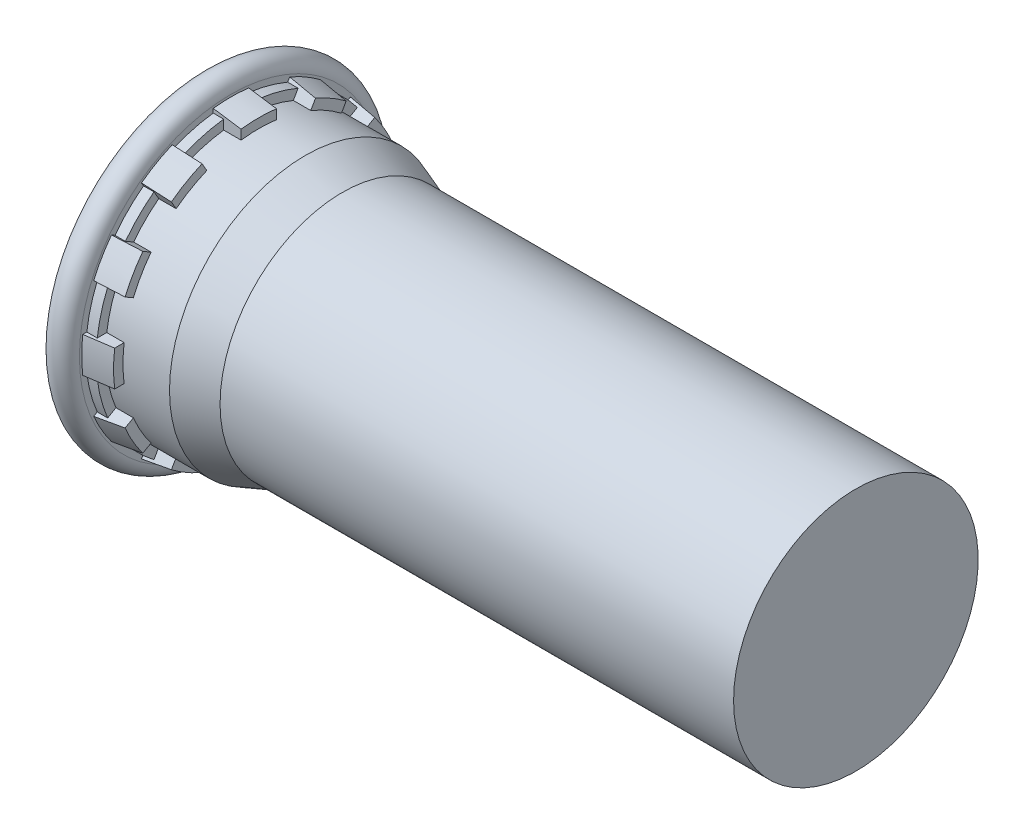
ISO-10303-21;
HEADER;
FILE_DESCRIPTION(('STEP AP214'),'2;1');
FILE_NAME('part.step','',(''),(''),'','','');
FILE_SCHEMA(('AUTOMOTIVE_DESIGN { 1 0 10303 214 1 1 1 1 }'));
ENDSEC;
DATA;
#1=APPLICATION_CONTEXT('core data for automotive mechanical design processes');
#2=APPLICATION_PROTOCOL_DEFINITION('international standard','automotive_design',2000,#1);
#3=PRODUCT_CONTEXT('',#1,'mechanical');
#4=PRODUCT('Part','Part','',(#3));
#5=PRODUCT_RELATED_PRODUCT_CATEGORY('part','',(#4));
#6=PRODUCT_DEFINITION_FORMATION('','',#4);
#7=PRODUCT_DEFINITION_CONTEXT('part definition',#1,'design');
#8=PRODUCT_DEFINITION('design','',#6,#7);
#9=PRODUCT_DEFINITION_SHAPE('','',#8);
#10=(LENGTH_UNIT() NAMED_UNIT(*) SI_UNIT(.MILLI.,.METRE.));
#11=(NAMED_UNIT(*) PLANE_ANGLE_UNIT() SI_UNIT($,.RADIAN.));
#12=(NAMED_UNIT(*) SI_UNIT($,.STERADIAN.) SOLID_ANGLE_UNIT());
#13=UNCERTAINTY_MEASURE_WITH_UNIT(LENGTH_MEASURE(1.E-05),#10,'distance_accuracy_value','');
#14=(GEOMETRIC_REPRESENTATION_CONTEXT(3) GLOBAL_UNCERTAINTY_ASSIGNED_CONTEXT((#13)) GLOBAL_UNIT_ASSIGNED_CONTEXT((#10,
#11,#12)) REPRESENTATION_CONTEXT('',''));
#15=CARTESIAN_POINT('',(0.,0.,0.));
#16=DIRECTION('',(0.,0.,1.));
#17=DIRECTION('',(1.,0.,0.));
#18=AXIS2_PLACEMENT_3D('',#15,#16,#17);
#19=CARTESIAN_POINT('',(0.8128,0.,0.));
#20=DIRECTION('',(-1.,0.,0.));
#21=DIRECTION('',(0.,0.,1.));
#22=AXIS2_PLACEMENT_3D('',#19,#20,#21);
#23=CONICAL_SURFACE('',#22,4.3561,0.14430247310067);
#24=CARTESIAN_POINT('',(0.8128,0.,0.));
#25=DIRECTION('',(-1.,0.,0.));
#26=DIRECTION('',(0.,0.,1.));
#27=AXIS2_PLACEMENT_3D('',#24,#25,#26);
#28=CIRCLE('',#27,4.3561);
#29=CARTESIAN_POINT('',(0.8128,3.48721061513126,2.61054962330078));
#30=VERTEX_POINT('',#29);
#31=CARTESIAN_POINT('',(0.8128,4.004407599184,1.71473816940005));
#32=VERTEX_POINT('',#31);
#33=EDGE_CURVE('E966',#30,#32,#28,.T.);
#34=ORIENTED_EDGE('',*,*,#33,.F.);
#35=CARTESIAN_POINT('',(1.6258,3.384149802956,2.55104743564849));
#36=CARTESIAN_POINT('',(1.45633378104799,3.4056366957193,2.56345289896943));
#37=CARTESIAN_POINT('',(1.28686711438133,3.42712093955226,2.57585683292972));
#38=CARTESIAN_POINT('',(1.01580016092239,3.46148129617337,2.59569479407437));
#39=CARTESIAN_POINT('',(0.914200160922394,3.47435910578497,2.6031298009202));
#40=CARTESIAN_POINT('',(0.8126,3.48723596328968,2.61056425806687));
#41=B_SPLINE_CURVE_WITH_KNOTS('',3,(#35,#36,#37,#38,#39,#40),.UNSPECIFIED.,.F.,.F.,(4,2,4),(0.,
0.513818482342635,0.821865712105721),.UNSPECIFIED.);
#42=CARTESIAN_POINT('',(1.6256,3.38417516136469,2.55106207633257));
#43=VERTEX_POINT('',#42);
#44=EDGE_CURVE('E967',#43,#30,#41,.T.);
#45=ORIENTED_EDGE('',*,*,#44,.F.);
#46=CARTESIAN_POINT('',(1.6256,0.,0.));
#47=DIRECTION('',(-1.,0.,0.));
#48=DIRECTION('',(0.,0.,1.));
#49=AXIS2_PLACEMENT_3D('',#46,#47,#48);
#50=CIRCLE('',#49,4.23799);
#51=CARTESIAN_POINT('',(1.6256,3.90137214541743,1.65525062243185));
#52=VERTEX_POINT('',#51);
#53=EDGE_CURVE('E1235',#43,#52,#50,.T.);
#54=ORIENTED_EDGE('',*,*,#53,.T.);
#55=CARTESIAN_POINT('',(0.8126,4.00443294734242,1.71475280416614));
#56=CARTESIAN_POINT('',(0.914200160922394,3.99155608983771,1.70731834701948));
#57=CARTESIAN_POINT('',(1.01580016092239,3.97867828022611,1.69988334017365));
#58=CARTESIAN_POINT('',(1.28686711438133,3.94431792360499,1.680045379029));
#59=CARTESIAN_POINT('',(1.45633378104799,3.92283367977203,1.6676414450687));
#60=CARTESIAN_POINT('',(1.6258,3.90134678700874,1.65523598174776));
#61=B_SPLINE_CURVE_WITH_KNOTS('',3,(#55,#56,#57,#58,#59,#60),.UNSPECIFIED.,.F.,.F.,(4,2,4),(0.,
0.308047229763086,0.821865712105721),.UNSPECIFIED.);
#62=EDGE_CURVE('E855',#32,#52,#61,.T.);
#63=ORIENTED_EDGE('',*,*,#62,.F.);
#64=EDGE_LOOP('',(#34,#45,#54,#63));
#65=FACE_BOUND('',#64,.T.);
#66=ADVANCED_FACE('F39',(#65),#23,.T.);
#67=CARTESIAN_POINT('',(0.8126,2.61056425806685,3.48723596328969));
#68=CARTESIAN_POINT('',(0.914200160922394,2.60312980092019,3.47435910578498));
#69=CARTESIAN_POINT('',(1.01580016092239,2.59569479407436,3.46148129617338));
#70=CARTESIAN_POINT('',(1.28686711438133,2.57585683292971,3.42712093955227));
#71=CARTESIAN_POINT('',(1.45633378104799,2.56345289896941,3.40563669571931));
#72=CARTESIAN_POINT('',(1.6258,2.55104743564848,3.38414980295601));
#73=B_SPLINE_CURVE_WITH_KNOTS('',3,(#67,#68,#69,#70,#71,#72),.UNSPECIFIED.,.F.,.F.,(4,2,4),(0.,
0.308047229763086,0.821865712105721),.UNSPECIFIED.);
#74=CARTESIAN_POINT('',(0.8128,2.61054962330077,3.48721061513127));
#75=VERTEX_POINT('',#74);
#76=CARTESIAN_POINT('',(1.6256,2.55106207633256,3.3841751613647));
#77=VERTEX_POINT('',#76);
#78=EDGE_CURVE('E1274',#75,#77,#73,.T.);
#79=ORIENTED_EDGE('',*,*,#78,.F.);
#80=CARTESIAN_POINT('',(0.8128,1.71473816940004,4.004407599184));
#81=VERTEX_POINT('',#80);
#82=EDGE_CURVE('E501',#81,#75,#28,.T.);
#83=ORIENTED_EDGE('',*,*,#82,.F.);
#84=CARTESIAN_POINT('',(1.6258,1.65523598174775,3.90134678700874));
#85=CARTESIAN_POINT('',(1.45633378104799,1.66764144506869,3.92283367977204));
#86=CARTESIAN_POINT('',(1.28686711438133,1.68004537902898,3.944317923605));
#87=CARTESIAN_POINT('',(1.01580016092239,1.69988334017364,3.97867828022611));
#88=CARTESIAN_POINT('',(0.914200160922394,1.70731834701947,3.99155608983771));
#89=CARTESIAN_POINT('',(0.8126,1.71475280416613,4.00443294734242));
#90=B_SPLINE_CURVE_WITH_KNOTS('',3,(#84,#85,#86,#87,#88,#89),.UNSPECIFIED.,.F.,.F.,(4,2,4),(0.,
0.513818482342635,0.821865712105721),.UNSPECIFIED.);
#91=CARTESIAN_POINT('',(1.6256,1.65525062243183,3.90137214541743));
#92=VERTEX_POINT('',#91);
#93=EDGE_CURVE('E1016',#92,#81,#90,.T.);
#94=ORIENTED_EDGE('',*,*,#93,.F.);
#95=EDGE_CURVE('E1240',#92,#77,#50,.T.);
#96=ORIENTED_EDGE('',*,*,#95,.T.);
#97=EDGE_LOOP('',(#79,#83,#94,#96));
#98=FACE_BOUND('',#97,.T.);
#99=ADVANCED_FACE('F955',(#98),#23,.T.);
#100=CARTESIAN_POINT('',(-0.595805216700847,0.517196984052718,4.53136778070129));
#101=CARTESIAN_POINT('',(-0.413195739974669,0.517196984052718,4.50466004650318));
#102=CARTESIAN_POINT('',(-0.230586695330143,0.517196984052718,4.4779493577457));
#103=CARTESIAN_POINT('',(0.360223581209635,0.517196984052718,4.39151967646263));
#104=CARTESIAN_POINT('',(0.76842297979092,0.517196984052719,4.33178815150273));
#105=CARTESIAN_POINT('',(1.58481659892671,0.517196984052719,4.21228972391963));
#106=CARTESIAN_POINT('',(1.99301081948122,0.517196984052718,4.15252282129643));
#107=CARTESIAN_POINT('',(2.41178610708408,0.517196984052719,4.09118557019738));
#108=CARTESIAN_POINT('',(2.42237012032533,0.517196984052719,4.08963533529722));
#109=CARTESIAN_POINT('',(2.43295413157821,0.517196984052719,4.08808508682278));
#110=B_SPLINE_CURVE_WITH_KNOTS('',3,(#100,#101,#102,#103,#104,#105,#106,#107,#108,#109),
.UNSPECIFIED.,.F.,.F.,(4,2,2,2,4),(0.,0.553656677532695,1.79129613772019,3.0289355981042,
3.06102642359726),.UNSPECIFIED.);
#111=CARTESIAN_POINT('',(0.8128,0.517196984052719,4.32528779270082));
#112=VERTEX_POINT('',#111);
#113=CARTESIAN_POINT('',(1.6256,0.517196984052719,4.20631269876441));
#114=VERTEX_POINT('',#113);
#115=EDGE_CURVE('E1012',#112,#114,#110,.T.);
#116=ORIENTED_EDGE('',*,*,#115,.F.);
#117=CARTESIAN_POINT('',(0.8128,-0.517196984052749,4.32528779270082));
#118=VERTEX_POINT('',#117);
#119=EDGE_CURVE('E973',#118,#112,#28,.T.);
#120=ORIENTED_EDGE('',*,*,#119,.F.);
#121=CARTESIAN_POINT('',(2.43295413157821,-0.517196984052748,4.08808508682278));
#122=CARTESIAN_POINT('',(2.42237012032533,-0.517196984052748,4.08963533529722));
#123=CARTESIAN_POINT('',(2.41178610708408,-0.517196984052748,4.09118557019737));
#124=CARTESIAN_POINT('',(1.99301081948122,-0.517196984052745,4.15252282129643));
#125=CARTESIAN_POINT('',(1.58481659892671,-0.517196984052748,4.21228972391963));
#126=CARTESIAN_POINT('',(0.768422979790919,-0.51719698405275,4.33178815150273));
#127=CARTESIAN_POINT('',(0.360223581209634,-0.51719698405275,4.39151967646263));
#128=CARTESIAN_POINT('',(-0.230586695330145,-0.517196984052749,4.4779493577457));
#129=CARTESIAN_POINT('',(-0.413195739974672,-0.517196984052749,4.50466004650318));
#130=CARTESIAN_POINT('',(-0.59580521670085,-0.517196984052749,4.53136778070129));
#131=B_SPLINE_CURVE_WITH_KNOTS('',3,(#121,#122,#123,#124,#125,#126,#127,#128,#129,#130),
.UNSPECIFIED.,.F.,.F.,(4,2,2,2,4),(0.,0.03209082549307,1.26973028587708,2.50736974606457,
3.06102642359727),.UNSPECIFIED.);
#132=CARTESIAN_POINT('',(1.6256,-0.517196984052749,4.20631269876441));
#133=VERTEX_POINT('',#132);
#134=EDGE_CURVE('E1010',#133,#118,#131,.T.);
#135=ORIENTED_EDGE('',*,*,#134,.F.);
#136=EDGE_CURVE('E1013',#133,#114,#50,.T.);
#137=ORIENTED_EDGE('',*,*,#136,.T.);
#138=EDGE_LOOP('',(#116,#120,#135,#137));
#139=FACE_BOUND('',#138,.T.);
#140=ADVANCED_FACE('F961',(#139),#23,.T.);
#141=CARTESIAN_POINT('',(0.8126,-1.71475280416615,4.00443294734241));
#142=CARTESIAN_POINT('',(0.914200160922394,-1.70731834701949,3.9915560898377));
#143=CARTESIAN_POINT('',(1.01580016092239,-1.69988334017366,3.9786782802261));
#144=CARTESIAN_POINT('',(1.28686711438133,-1.68004537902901,3.94431792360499));
#145=CARTESIAN_POINT('',(1.45633378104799,-1.66764144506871,3.92283367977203));
#146=CARTESIAN_POINT('',(1.6258,-1.65523598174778,3.90134678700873));
#147=B_SPLINE_CURVE_WITH_KNOTS('',3,(#141,#142,#143,#144,#145,#146),.UNSPECIFIED.,.F.,.F.,(4,2,
4),(0.,0.308047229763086,0.821865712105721),.UNSPECIFIED.);
#148=CARTESIAN_POINT('',(0.8128,-1.71473816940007,4.00440759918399));
#149=VERTEX_POINT('',#148);
#150=CARTESIAN_POINT('',(1.6256,-1.65525062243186,3.90137214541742));
#151=VERTEX_POINT('',#150);
#152=EDGE_CURVE('E1032',#149,#151,#147,.T.);
#153=ORIENTED_EDGE('',*,*,#152,.F.);
#154=CARTESIAN_POINT('',(0.8128,-2.61054962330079,3.48721061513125));
#155=VERTEX_POINT('',#154);
#156=EDGE_CURVE('E998',#155,#149,#28,.T.);
#157=ORIENTED_EDGE('',*,*,#156,.F.);
#158=CARTESIAN_POINT('',(1.6258,-2.5510474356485,3.38414980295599));
#159=CARTESIAN_POINT('',(1.45633378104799,-2.56345289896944,3.40563669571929));
#160=CARTESIAN_POINT('',(1.28686711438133,-2.57585683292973,3.42712093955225));
#161=CARTESIAN_POINT('',(1.01580016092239,-2.59569479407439,3.46148129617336));
#162=CARTESIAN_POINT('',(0.914200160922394,-2.60312980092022,3.47435910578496));
#163=CARTESIAN_POINT('',(0.8126,-2.61056425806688,3.48723596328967));
#164=B_SPLINE_CURVE_WITH_KNOTS('',3,(#158,#159,#160,#161,#162,#163),.UNSPECIFIED.,.F.,.F.,(4,2,
4),(0.,0.513818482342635,0.821865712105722),.UNSPECIFIED.);
#165=CARTESIAN_POINT('',(1.6256,-2.55106207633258,3.38417516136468));
#166=VERTEX_POINT('',#165);
#167=EDGE_CURVE('E1084',#166,#155,#164,.T.);
#168=ORIENTED_EDGE('',*,*,#167,.F.);
#169=EDGE_CURVE('E1346',#166,#151,#50,.T.);
#170=ORIENTED_EDGE('',*,*,#169,.T.);
#171=EDGE_LOOP('',(#153,#157,#168,#170));
#172=FACE_BOUND('',#171,.T.);
#173=ADVANCED_FACE('F1481',(#172),#23,.T.);
#174=CARTESIAN_POINT('',(0.8126,-3.4872359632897,2.61056425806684));
#175=CARTESIAN_POINT('',(0.914200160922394,-3.47435910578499,2.60312980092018));
#176=CARTESIAN_POINT('',(1.01580016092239,-3.46148129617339,2.59569479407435));
#177=CARTESIAN_POINT('',(1.28686711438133,-3.42712093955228,2.5758568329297));
#178=CARTESIAN_POINT('',(1.45633378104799,-3.40563669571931,2.5634528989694));
#179=CARTESIAN_POINT('',(1.6258,-3.38414980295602,2.55104743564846));
#180=B_SPLINE_CURVE_WITH_KNOTS('',3,(#174,#175,#176,#177,#178,#179),.UNSPECIFIED.,.F.,.F.,(4,2,
4),(0.,0.308047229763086,0.821865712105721),.UNSPECIFIED.);
#181=CARTESIAN_POINT('',(0.8128,-3.48721061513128,2.61054962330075));
#182=VERTEX_POINT('',#181);
#183=CARTESIAN_POINT('',(1.6256,-3.38417516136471,2.55106207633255));
#184=VERTEX_POINT('',#183);
#185=EDGE_CURVE('E1078',#182,#184,#180,.T.);
#186=ORIENTED_EDGE('',*,*,#185,.F.);
#187=CARTESIAN_POINT('',(0.8128,-4.00440759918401,1.71473816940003));
#188=VERTEX_POINT('',#187);
#189=EDGE_CURVE('E995',#188,#182,#28,.T.);
#190=ORIENTED_EDGE('',*,*,#189,.F.);
#191=CARTESIAN_POINT('',(1.6258,-3.90134678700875,1.65523598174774));
#192=CARTESIAN_POINT('',(1.45633378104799,-3.92283367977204,1.66764144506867));
#193=CARTESIAN_POINT('',(1.28686711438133,-3.944317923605,1.68004537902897));
#194=CARTESIAN_POINT('',(1.01580016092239,-3.97867828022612,1.69988334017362));
#195=CARTESIAN_POINT('',(0.914200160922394,-3.99155608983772,1.70731834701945));
#196=CARTESIAN_POINT('',(0.8126,-4.00443294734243,1.71475280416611));
#197=B_SPLINE_CURVE_WITH_KNOTS('',3,(#191,#192,#193,#194,#195,#196),.UNSPECIFIED.,.F.,.F.,(4,2,
4),(0.,0.513818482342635,0.821865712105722),.UNSPECIFIED.);
#198=CARTESIAN_POINT('',(1.6256,-3.90137214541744,1.65525062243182));
#199=VERTEX_POINT('',#198);
#200=EDGE_CURVE('E1119',#199,#188,#197,.T.);
#201=ORIENTED_EDGE('',*,*,#200,.F.);
#202=EDGE_CURVE('E1341',#199,#184,#50,.T.);
#203=ORIENTED_EDGE('',*,*,#202,.T.);
#204=EDGE_LOOP('',(#186,#190,#201,#203));
#205=FACE_BOUND('',#204,.T.);
#206=ADVANCED_FACE('F1452',(#205),#23,.T.);
#207=CARTESIAN_POINT('',(-0.595805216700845,-4.5313677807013,0.517196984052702));
#208=CARTESIAN_POINT('',(-0.413195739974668,-4.50466004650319,0.517196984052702));
#209=CARTESIAN_POINT('',(-0.230586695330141,-4.4779493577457,0.517196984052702));
#210=CARTESIAN_POINT('',(0.360223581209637,-4.39151967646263,0.517196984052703));
#211=CARTESIAN_POINT('',(0.768422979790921,-4.33178815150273,0.517196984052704));
#212=CARTESIAN_POINT('',(1.58481659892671,-4.21228972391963,0.517196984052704));
#213=CARTESIAN_POINT('',(1.99301081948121,-4.15252282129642,0.517196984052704));
#214=CARTESIAN_POINT('',(2.41178610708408,-4.09118557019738,0.517196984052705));
#215=CARTESIAN_POINT('',(2.42237012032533,-4.08963533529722,0.517196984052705));
#216=CARTESIAN_POINT('',(2.43295413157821,-4.08808508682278,0.517196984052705));
#217=B_SPLINE_CURVE_WITH_KNOTS('',3,(#207,#208,#209,#210,#211,#212,#213,#214,#215,#216),
.UNSPECIFIED.,.F.,.F.,(4,2,2,2,4),(0.,0.553656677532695,1.79129613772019,3.02893559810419,
3.06102642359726),.UNSPECIFIED.);
#218=CARTESIAN_POINT('',(0.8128,-4.32528779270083,0.517196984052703));
#219=VERTEX_POINT('',#218);
#220=CARTESIAN_POINT('',(1.6256,-4.20631269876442,0.517196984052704));
#221=VERTEX_POINT('',#220);
#222=EDGE_CURVE('E1113',#219,#221,#217,.T.);
#223=ORIENTED_EDGE('',*,*,#222,.F.);
#224=CARTESIAN_POINT('',(0.8128,-4.32528779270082,-0.517196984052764));
#225=VERTEX_POINT('',#224);
#226=EDGE_CURVE('E992',#225,#219,#28,.T.);
#227=ORIENTED_EDGE('',*,*,#226,.F.);
#228=CARTESIAN_POINT('',(2.43295413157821,-4.08808508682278,-0.517196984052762));
#229=CARTESIAN_POINT('',(2.42237012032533,-4.08963533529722,-0.517196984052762));
#230=CARTESIAN_POINT('',(2.41178610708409,-4.09118557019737,-0.517196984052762));
#231=CARTESIAN_POINT('',(1.99301081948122,-4.15252282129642,-0.517196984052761));
#232=CARTESIAN_POINT('',(1.58481659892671,-4.21228972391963,-0.517196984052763));
#233=CARTESIAN_POINT('',(0.768422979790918,-4.33178815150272,-0.517196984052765));
#234=CARTESIAN_POINT('',(0.360223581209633,-4.39151967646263,-0.517196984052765));
#235=CARTESIAN_POINT('',(-0.230586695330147,-4.4779493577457,-0.517196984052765));
#236=CARTESIAN_POINT('',(-0.413195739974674,-4.50466004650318,-0.517196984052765));
#237=CARTESIAN_POINT('',(-0.595805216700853,-4.53136778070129,-0.517196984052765));
#238=B_SPLINE_CURVE_WITH_KNOTS('',3,(#228,#229,#230,#231,#232,#233,#234,#235,#236,#237),
.UNSPECIFIED.,.F.,.F.,(4,2,2,2,4),(0.,0.0320908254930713,1.26973028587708,2.50736974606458,
3.06102642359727),.UNSPECIFIED.);
#239=CARTESIAN_POINT('',(1.6256,-4.20631269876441,-0.517196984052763));
#240=VERTEX_POINT('',#239);
#241=EDGE_CURVE('E1132',#240,#225,#238,.T.);
#242=ORIENTED_EDGE('',*,*,#241,.F.);
#243=EDGE_CURVE('E1336',#240,#221,#50,.T.);
#244=ORIENTED_EDGE('',*,*,#243,.T.);
#245=EDGE_LOOP('',(#223,#227,#242,#244));
#246=FACE_BOUND('',#245,.T.);
#247=ADVANCED_FACE('F1448',(#246),#23,.T.);
#248=CARTESIAN_POINT('',(0.8126,-4.00443294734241,-1.71475280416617));
#249=CARTESIAN_POINT('',(0.914200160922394,-3.9915560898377,-1.70731834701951));
#250=CARTESIAN_POINT('',(1.01580016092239,-3.9786782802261,-1.69988334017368));
#251=CARTESIAN_POINT('',(1.28686711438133,-3.94431792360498,-1.68004537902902));
#252=CARTESIAN_POINT('',(1.45633378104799,-3.92283367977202,-1.66764144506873));
#253=CARTESIAN_POINT('',(1.6258,-3.90134678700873,-1.65523598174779));
#254=B_SPLINE_CURVE_WITH_KNOTS('',3,(#248,#249,#250,#251,#252,#253),.UNSPECIFIED.,.F.,.F.,(4,2,
4),(0.,0.308047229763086,0.821865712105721),.UNSPECIFIED.);
#255=CARTESIAN_POINT('',(0.8128,-4.00440759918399,-1.71473816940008));
#256=VERTEX_POINT('',#255);
#257=CARTESIAN_POINT('',(1.6256,-3.90137214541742,-1.65525062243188));
#258=VERTEX_POINT('',#257);
#259=EDGE_CURVE('E1125',#256,#258,#254,.T.);
#260=ORIENTED_EDGE('',*,*,#259,.F.);
#261=CARTESIAN_POINT('',(0.8128,-3.48721061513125,-2.6105496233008));
#262=VERTEX_POINT('',#261);
#263=EDGE_CURVE('E989',#262,#256,#28,.T.);
#264=ORIENTED_EDGE('',*,*,#263,.F.);
#265=CARTESIAN_POINT('',(1.6258,-3.38414980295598,-2.55104743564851));
#266=CARTESIAN_POINT('',(1.45633378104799,-3.40563669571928,-2.56345289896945));
#267=CARTESIAN_POINT('',(1.28686711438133,-3.42712093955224,-2.57585683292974));
#268=CARTESIAN_POINT('',(1.01580016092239,-3.46148129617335,-2.5956947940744));
#269=CARTESIAN_POINT('',(0.914200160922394,-3.47435910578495,-2.60312980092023));
#270=CARTESIAN_POINT('',(0.8126,-3.48723596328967,-2.61056425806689));
#271=B_SPLINE_CURVE_WITH_KNOTS('',3,(#265,#266,#267,#268,#269,#270),.UNSPECIFIED.,.F.,.F.,(4,2,
4),(0.,0.513818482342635,0.821865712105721),.UNSPECIFIED.);
#272=CARTESIAN_POINT('',(1.6256,-3.38417516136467,-2.5510620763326));
#273=VERTEX_POINT('',#272);
#274=EDGE_CURVE('E1167',#273,#262,#271,.T.);
#275=ORIENTED_EDGE('',*,*,#274,.F.);
#276=EDGE_CURVE('E1331',#273,#258,#50,.T.);
#277=ORIENTED_EDGE('',*,*,#276,.T.);
#278=EDGE_LOOP('',(#260,#264,#275,#277));
#279=FACE_BOUND('',#278,.T.);
#280=ADVANCED_FACE('F1444',(#279),#23,.T.);
#281=CARTESIAN_POINT('',(0.8126,-2.61056425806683,-3.48723596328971));
#282=CARTESIAN_POINT('',(0.914200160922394,-2.60312980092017,-3.474359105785));
#283=CARTESIAN_POINT('',(1.01580016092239,-2.59569479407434,-3.4614812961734));
#284=CARTESIAN_POINT('',(1.28686711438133,-2.57585683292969,-3.42712093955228));
#285=CARTESIAN_POINT('',(1.45633378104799,-2.56345289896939,-3.40563669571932));
#286=CARTESIAN_POINT('',(1.6258,-2.55104743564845,-3.38414980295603));
#287=B_SPLINE_CURVE_WITH_KNOTS('',3,(#281,#282,#283,#284,#285,#286),.UNSPECIFIED.,.F.,.F.,(4,2,
4),(0.,0.308047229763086,0.821865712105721),.UNSPECIFIED.);
#288=CARTESIAN_POINT('',(0.8128,-2.61054962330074,-3.48721061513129));
#289=VERTEX_POINT('',#288);
#290=CARTESIAN_POINT('',(1.6256,-2.55106207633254,-3.38417516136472));
#291=VERTEX_POINT('',#290);
#292=EDGE_CURVE('E1161',#289,#291,#287,.T.);
#293=ORIENTED_EDGE('',*,*,#292,.F.);
#294=CARTESIAN_POINT('',(0.8128,-1.71473816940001,-4.00440759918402));
#295=VERTEX_POINT('',#294);
#296=EDGE_CURVE('E986',#295,#289,#28,.T.);
#297=ORIENTED_EDGE('',*,*,#296,.F.);
#298=CARTESIAN_POINT('',(1.6258,-1.65523598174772,-3.90134678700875));
#299=CARTESIAN_POINT('',(1.45633378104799,-1.66764144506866,-3.92283367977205));
#300=CARTESIAN_POINT('',(1.28686711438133,-1.68004537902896,-3.94431792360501));
#301=CARTESIAN_POINT('',(1.01580016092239,-1.69988334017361,-3.97867828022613));
#302=CARTESIAN_POINT('',(0.914200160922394,-1.70731834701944,-3.99155608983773));
#303=CARTESIAN_POINT('',(0.8126,-1.7147528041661,-4.00443294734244));
#304=B_SPLINE_CURVE_WITH_KNOTS('',3,(#298,#299,#300,#301,#302,#303),.UNSPECIFIED.,.F.,.F.,(4,2,
4),(0.,0.513818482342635,0.821865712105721),.UNSPECIFIED.);
#305=CARTESIAN_POINT('',(1.6256,-1.65525062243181,-3.90137214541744));
#306=VERTEX_POINT('',#305);
#307=EDGE_CURVE('E1180',#306,#295,#304,.T.);
#308=ORIENTED_EDGE('',*,*,#307,.F.);
#309=EDGE_CURVE('E1329',#306,#291,#50,.T.);
#310=ORIENTED_EDGE('',*,*,#309,.T.);
#311=EDGE_LOOP('',(#293,#297,#308,#310));
#312=FACE_BOUND('',#311,.T.);
#313=ADVANCED_FACE('F1425',(#312),#23,.T.);
#314=CARTESIAN_POINT('',(-0.595805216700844,-0.517196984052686,-4.5313677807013));
#315=CARTESIAN_POINT('',(-0.413195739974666,-0.517196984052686,-4.50466004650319));
#316=CARTESIAN_POINT('',(-0.23058669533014,-0.517196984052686,-4.47794935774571));
#317=CARTESIAN_POINT('',(0.360223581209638,-0.517196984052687,-4.39151967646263));
#318=CARTESIAN_POINT('',(0.768422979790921,-0.517196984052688,-4.33178815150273));
#319=CARTESIAN_POINT('',(1.58481659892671,-0.517196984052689,-4.21228972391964));
#320=CARTESIAN_POINT('',(1.99301081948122,-0.517196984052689,-4.15252282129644));
#321=CARTESIAN_POINT('',(2.41178610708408,-0.517196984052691,-4.09118557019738));
#322=CARTESIAN_POINT('',(2.42237012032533,-0.517196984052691,-4.08963533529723));
#323=CARTESIAN_POINT('',(2.43295413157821,-0.517196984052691,-4.08808508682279));
#324=B_SPLINE_CURVE_WITH_KNOTS('',3,(#314,#315,#316,#317,#318,#319,#320,#321,#322,#323),
.UNSPECIFIED.,.F.,.F.,(4,2,2,2,4),(0.,0.553656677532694,1.79129613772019,3.02893559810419,
3.06102642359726),.UNSPECIFIED.);
#325=CARTESIAN_POINT('',(0.8128,-0.517196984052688,-4.32528779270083));
#326=VERTEX_POINT('',#325);
#327=CARTESIAN_POINT('',(1.6256,-0.51719698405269,-4.20631269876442));
#328=VERTEX_POINT('',#327);
#329=EDGE_CURVE('E1173',#326,#328,#324,.T.);
#330=ORIENTED_EDGE('',*,*,#329,.F.);
#331=CARTESIAN_POINT('',(0.8128,0.517196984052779,-4.32528779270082));
#332=VERTEX_POINT('',#331);
#333=EDGE_CURVE('E983',#332,#326,#28,.T.);
#334=ORIENTED_EDGE('',*,*,#333,.F.);
#335=CARTESIAN_POINT('',(2.43295413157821,0.517196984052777,-4.08808508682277));
#336=CARTESIAN_POINT('',(2.42237012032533,0.517196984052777,-4.08963533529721));
#337=CARTESIAN_POINT('',(2.41178610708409,0.517196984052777,-4.09118557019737));
#338=CARTESIAN_POINT('',(1.99301081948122,0.517196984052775,-4.15252282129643));
#339=CARTESIAN_POINT('',(1.58481659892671,0.517196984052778,-4.21228972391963));
#340=CARTESIAN_POINT('',(0.768422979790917,0.51719698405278,-4.33178815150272));
#341=CARTESIAN_POINT('',(0.360223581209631,0.517196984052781,-4.39151967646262));
#342=CARTESIAN_POINT('',(-0.230586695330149,0.517196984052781,-4.4779493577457));
#343=CARTESIAN_POINT('',(-0.413195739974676,0.517196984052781,-4.50466004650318));
#344=CARTESIAN_POINT('',(-0.595805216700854,0.517196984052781,-4.53136778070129));
#345=B_SPLINE_CURVE_WITH_KNOTS('',3,(#335,#336,#337,#338,#339,#340,#341,#342,#343,#344),
.UNSPECIFIED.,.F.,.F.,(4,2,2,2,4),(0.,0.0320908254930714,1.26973028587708,2.50736974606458,
3.06102642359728),.UNSPECIFIED.);
#346=CARTESIAN_POINT('',(1.6256,0.517196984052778,-4.20631269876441));
#347=VERTEX_POINT('',#346);
#348=EDGE_CURVE('E1212',#347,#332,#345,.T.);
#349=ORIENTED_EDGE('',*,*,#348,.F.);
#350=EDGE_CURVE('E1238',#347,#328,#50,.T.);
#351=ORIENTED_EDGE('',*,*,#350,.T.);
#352=EDGE_LOOP('',(#330,#334,#349,#351));
#353=FACE_BOUND('',#352,.T.);
#354=ADVANCED_FACE('F1436',(#353),#23,.T.);
#355=CARTESIAN_POINT('',(0.8126,1.71475280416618,-4.0044329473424));
#356=CARTESIAN_POINT('',(0.914200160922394,1.70731834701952,-3.99155608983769));
#357=CARTESIAN_POINT('',(1.01580016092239,1.69988334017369,-3.97867828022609));
#358=CARTESIAN_POINT('',(1.28686711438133,1.68004537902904,-3.94431792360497));
#359=CARTESIAN_POINT('',(1.45633378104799,1.66764144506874,-3.92283367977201));
#360=CARTESIAN_POINT('',(1.6258,1.65523598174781,-3.90134678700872));
#361=B_SPLINE_CURVE_WITH_KNOTS('',3,(#355,#356,#357,#358,#359,#360),.UNSPECIFIED.,.F.,.F.,(4,2,
4),(0.,0.308047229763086,0.821865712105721),.UNSPECIFIED.);
#362=CARTESIAN_POINT('',(0.8128,1.7147381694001,-4.00440759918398));
#363=VERTEX_POINT('',#362);
#364=CARTESIAN_POINT('',(1.6256,1.65525062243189,-3.90137214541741));
#365=VERTEX_POINT('',#364);
#366=EDGE_CURVE('E1207',#363,#365,#361,.T.);
#367=ORIENTED_EDGE('',*,*,#366,.F.);
#368=CARTESIAN_POINT('',(0.8128,2.61054962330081,-3.48721061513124));
#369=VERTEX_POINT('',#368);
#370=EDGE_CURVE('E975',#369,#363,#28,.T.);
#371=ORIENTED_EDGE('',*,*,#370,.F.);
#372=CARTESIAN_POINT('',(1.6258,2.55104743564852,-3.38414980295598));
#373=CARTESIAN_POINT('',(1.45633378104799,2.56345289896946,-3.40563669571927));
#374=CARTESIAN_POINT('',(1.28686711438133,2.57585683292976,-3.42712093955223));
#375=CARTESIAN_POINT('',(1.01580016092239,2.59569479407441,-3.46148129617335));
#376=CARTESIAN_POINT('',(0.914200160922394,2.60312980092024,-3.47435910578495));
#377=CARTESIAN_POINT('',(0.8126,2.6105642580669,-3.48723596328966));
#378=B_SPLINE_CURVE_WITH_KNOTS('',3,(#372,#373,#374,#375,#376,#377),.UNSPECIFIED.,.F.,.F.,(4,2,
4),(0.,0.513818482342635,0.821865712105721),.UNSPECIFIED.);
#379=CARTESIAN_POINT('',(1.6256,2.55106207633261,-3.38417516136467));
#380=VERTEX_POINT('',#379);
#381=EDGE_CURVE('E662',#380,#369,#378,.T.);
#382=ORIENTED_EDGE('',*,*,#381,.F.);
#383=EDGE_CURVE('E1234',#380,#365,#50,.T.);
#384=ORIENTED_EDGE('',*,*,#383,.T.);
#385=EDGE_LOOP('',(#367,#371,#382,#384));
#386=FACE_BOUND('',#385,.T.);
#387=ADVANCED_FACE('F1438',(#386),#23,.T.);
#388=CARTESIAN_POINT('',(0.8128,4.32528779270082,0.517196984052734));
#389=VERTEX_POINT('',#388);
#390=CARTESIAN_POINT('',(0.8128,4.32528779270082,-0.517196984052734));
#391=VERTEX_POINT('',#390);
#392=EDGE_CURVE('E970',#389,#391,#28,.T.);
#393=ORIENTED_EDGE('',*,*,#392,.F.);
#394=CARTESIAN_POINT('',(2.43295413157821,4.08808508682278,0.517196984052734));
#395=CARTESIAN_POINT('',(2.42237012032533,4.08963533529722,0.517196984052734));
#396=CARTESIAN_POINT('',(2.41178610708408,4.09118557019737,0.517196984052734));
#397=CARTESIAN_POINT('',(1.99301081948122,4.15252282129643,0.517196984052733));
#398=CARTESIAN_POINT('',(1.58481659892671,4.21228972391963,0.517196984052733));
#399=CARTESIAN_POINT('',(0.768422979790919,4.33178815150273,0.517196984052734));
#400=CARTESIAN_POINT('',(0.360223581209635,4.39151967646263,0.517196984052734));
#401=CARTESIAN_POINT('',(-0.230586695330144,4.4779493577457,0.517196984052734));
#402=CARTESIAN_POINT('',(-0.413195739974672,4.50466004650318,0.517196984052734));
#403=CARTESIAN_POINT('',(-0.595805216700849,4.53136778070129,0.517196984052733));
#404=B_SPLINE_CURVE_WITH_KNOTS('',3,(#394,#395,#396,#397,#398,#399,#400,#401,#402,#403),
.UNSPECIFIED.,.F.,.F.,(4,2,2,2,4),(0.,0.03209082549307,1.26973028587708,2.50736974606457,
3.06102642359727),.UNSPECIFIED.);
#405=CARTESIAN_POINT('',(1.6256,4.20631269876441,0.517196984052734));
#406=VERTEX_POINT('',#405);
#407=EDGE_CURVE('E864',#406,#389,#404,.T.);
#408=ORIENTED_EDGE('',*,*,#407,.F.);
#409=CARTESIAN_POINT('',(1.6256,4.20631269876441,-0.517196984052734));
#410=VERTEX_POINT('',#409);
#411=EDGE_CURVE('E1236',#406,#410,#50,.T.);
#412=ORIENTED_EDGE('',*,*,#411,.T.);
#413=CARTESIAN_POINT('',(-0.595805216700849,4.53136778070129,-0.517196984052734));
#414=CARTESIAN_POINT('',(-0.413195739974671,4.50466004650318,-0.517196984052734));
#415=CARTESIAN_POINT('',(-0.230586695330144,4.4779493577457,-0.517196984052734));
#416=CARTESIAN_POINT('',(0.360223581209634,4.39151967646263,-0.517196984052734));
#417=CARTESIAN_POINT('',(0.768422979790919,4.33178815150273,-0.517196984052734));
#418=CARTESIAN_POINT('',(1.58481659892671,4.21228972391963,-0.517196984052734));
#419=CARTESIAN_POINT('',(1.99301081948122,4.15252282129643,-0.517196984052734));
#420=CARTESIAN_POINT('',(2.41178610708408,4.09118557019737,-0.517196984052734));
#421=CARTESIAN_POINT('',(2.42237012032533,4.08963533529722,-0.517196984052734));
#422=CARTESIAN_POINT('',(2.43295413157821,4.08808508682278,-0.517196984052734));
#423=B_SPLINE_CURVE_WITH_KNOTS('',3,(#413,#414,#415,#416,#417,#418,#419,#420,#421,#422),
.UNSPECIFIED.,.F.,.F.,(4,2,2,2,4),(0.,0.553656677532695,1.79129613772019,3.0289355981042,
3.06102642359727),.UNSPECIFIED.);
#424=EDGE_CURVE('E907',#391,#410,#423,.T.);
#425=ORIENTED_EDGE('',*,*,#424,.F.);
#426=EDGE_LOOP('',(#393,#408,#412,#425));
#427=FACE_BOUND('',#426,.T.);
#428=ADVANCED_FACE('F946',(#427),#23,.T.);
#429=CARTESIAN_POINT('',(1.6256,4.23799,0.));
#430=DIRECTION('',(1.,0.,0.));
#431=DIRECTION('',(0.,0.,-1.));
#432=AXIS2_PLACEMENT_3D('',#429,#430,#431);
#433=PLANE('',#432);
#434=DIRECTION('',(0.,-0.499999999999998,-0.86602540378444));
#435=VECTOR('',#434,1.);
#436=CARTESIAN_POINT('',(1.6256,2.41215628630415,3.14358327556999));
#437=LINE('',#436,#435);
#438=CARTESIAN_POINT('',(1.6256,2.41215628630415,3.14358327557));
#439=VERTEX_POINT('',#438);
#440=EDGE_CURVE('E653',#77,#439,#437,.T.);
#441=ORIENTED_EDGE('',*,*,#440,.F.);
#442=ORIENTED_EDGE('',*,*,#95,.F.);
#443=DIRECTION('',(0.,0.499999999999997,0.86602540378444));
#444=VECTOR('',#443,1.);
#445=CARTESIAN_POINT('',(1.6256,1.51634483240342,3.66078025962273));
#446=LINE('',#445,#444);
#447=CARTESIAN_POINT('',(1.6256,1.51634483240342,3.66078025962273));
#448=VERTEX_POINT('',#447);
#449=EDGE_CURVE('E674',#448,#92,#446,.T.);
#450=ORIENTED_EDGE('',*,*,#449,.F.);
#451=CARTESIAN_POINT('',(1.6256,0.,0.));
#452=DIRECTION('',(-1.,0.,0.));
#453=DIRECTION('',(0.,0.,1.));
#454=AXIS2_PLACEMENT_3D('',#451,#452,#453);
#455=CIRCLE('',#454,3.9624);
#456=EDGE_CURVE('E1252',#448,#439,#455,.T.);
#457=ORIENTED_EDGE('',*,*,#456,.T.);
#458=EDGE_LOOP('',(#441,#442,#450,#457));
#459=FACE_BOUND('',#458,.T.);
#460=ADVANCED_FACE('F940',(#459),#433,.T.);
#461=DIRECTION('',(0.,0.,-1.));
#462=VECTOR('',#461,1.);
#463=CARTESIAN_POINT('',(1.6256,0.51719698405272,3.92850111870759));
#464=LINE('',#463,#462);
#465=CARTESIAN_POINT('',(1.6256,0.51719698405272,3.92850111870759));
#466=VERTEX_POINT('',#465);
#467=EDGE_CURVE('E668',#114,#466,#464,.T.);
#468=ORIENTED_EDGE('',*,*,#467,.F.);
#469=ORIENTED_EDGE('',*,*,#136,.F.);
#470=DIRECTION('',(0.,0.,1.));
#471=VECTOR('',#470,1.);
#472=CARTESIAN_POINT('',(1.6256,-0.517196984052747,3.92850111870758));
#473=LINE('',#472,#471);
#474=CARTESIAN_POINT('',(1.6256,-0.517196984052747,3.92850111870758));
#475=VERTEX_POINT('',#474);
#476=EDGE_CURVE('E690',#475,#133,#473,.T.);
#477=ORIENTED_EDGE('',*,*,#476,.F.);
#478=EDGE_CURVE('E1383',#475,#466,#455,.T.);
#479=ORIENTED_EDGE('',*,*,#478,.T.);
#480=EDGE_LOOP('',(#468,#469,#477,#479));
#481=FACE_BOUND('',#480,.T.);
#482=ADVANCED_FACE('F949',(#481),#433,.T.);
#483=DIRECTION('',(0.,0.500000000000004,-0.866025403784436));
#484=VECTOR('',#483,1.);
#485=CARTESIAN_POINT('',(1.6256,-1.51634483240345,3.66078025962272));
#486=LINE('',#485,#484);
#487=CARTESIAN_POINT('',(1.6256,-1.51634483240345,3.66078025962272));
#488=VERTEX_POINT('',#487);
#489=EDGE_CURVE('E684',#151,#488,#486,.T.);
#490=ORIENTED_EDGE('',*,*,#489,.F.);
#491=ORIENTED_EDGE('',*,*,#169,.F.);
#492=DIRECTION('',(0.,-0.500000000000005,0.866025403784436));
#493=VECTOR('',#492,1.);
#494=CARTESIAN_POINT('',(1.6256,-2.41215628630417,3.14358327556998));
#495=LINE('',#494,#493);
#496=CARTESIAN_POINT('',(1.6256,-2.41215628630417,3.14358327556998));
#497=VERTEX_POINT('',#496);
#498=EDGE_CURVE('E707',#497,#166,#495,.T.);
#499=ORIENTED_EDGE('',*,*,#498,.F.);
#500=EDGE_CURVE('E1385',#497,#488,#455,.T.);
#501=ORIENTED_EDGE('',*,*,#500,.T.);
#502=EDGE_LOOP('',(#490,#491,#499,#501));
#503=FACE_BOUND('',#502,.T.);
#504=ADVANCED_FACE('F1482',(#503),#433,.T.);
#505=DIRECTION('',(0.,0.866025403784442,-0.499999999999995));
#506=VECTOR('',#505,1.);
#507=CARTESIAN_POINT('',(1.6256,-3.14358327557,2.41215628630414));
#508=LINE('',#507,#506);
#509=CARTESIAN_POINT('',(1.6256,-3.14358327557,2.41215628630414));
#510=VERTEX_POINT('',#509);
#511=EDGE_CURVE('E701',#184,#510,#508,.T.);
#512=ORIENTED_EDGE('',*,*,#511,.F.);
#513=ORIENTED_EDGE('',*,*,#202,.F.);
#514=DIRECTION('',(0.,-0.866025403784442,0.499999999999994));
#515=VECTOR('',#514,1.);
#516=CARTESIAN_POINT('',(1.6256,-3.66078025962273,1.51634483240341));
#517=LINE('',#516,#515);
#518=CARTESIAN_POINT('',(1.6256,-3.66078025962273,1.51634483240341));
#519=VERTEX_POINT('',#518);
#520=EDGE_CURVE('E724',#519,#199,#517,.T.);
#521=ORIENTED_EDGE('',*,*,#520,.F.);
#522=EDGE_CURVE('E1389',#519,#510,#455,.T.);
#523=ORIENTED_EDGE('',*,*,#522,.T.);
#524=EDGE_LOOP('',(#512,#513,#521,#523));
#525=FACE_BOUND('',#524,.T.);
#526=ADVANCED_FACE('F1471',(#525),#433,.T.);
#527=DIRECTION('',(0.,1.,0.));
#528=VECTOR('',#527,1.);
#529=CARTESIAN_POINT('',(1.6256,-3.92850111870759,0.517196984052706));
#530=LINE('',#529,#528);
#531=CARTESIAN_POINT('',(1.6256,-3.92850111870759,0.517196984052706));
#532=VERTEX_POINT('',#531);
#533=EDGE_CURVE('E718',#221,#532,#530,.T.);
#534=ORIENTED_EDGE('',*,*,#533,.F.);
#535=ORIENTED_EDGE('',*,*,#243,.F.);
#536=DIRECTION('',(0.,-1.,0.));
#537=VECTOR('',#536,1.);
#538=CARTESIAN_POINT('',(1.6256,-3.92850111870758,-0.517196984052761));
#539=LINE('',#538,#537);
#540=CARTESIAN_POINT('',(1.6256,-3.92850111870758,-0.517196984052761));
#541=VERTEX_POINT('',#540);
#542=EDGE_CURVE('E741',#541,#240,#539,.T.);
#543=ORIENTED_EDGE('',*,*,#542,.F.);
#544=EDGE_CURVE('E1395',#541,#532,#455,.T.);
#545=ORIENTED_EDGE('',*,*,#544,.T.);
#546=EDGE_LOOP('',(#534,#535,#543,#545));
#547=FACE_BOUND('',#546,.T.);
#548=ADVANCED_FACE('F1460',(#547),#433,.T.);
#549=DIRECTION('',(0.,0.866025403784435,0.500000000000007));
#550=VECTOR('',#549,1.);
#551=CARTESIAN_POINT('',(1.6256,-3.66078025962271,-1.51634483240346));
#552=LINE('',#551,#550);
#553=CARTESIAN_POINT('',(1.6256,-3.66078025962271,-1.51634483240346));
#554=VERTEX_POINT('',#553);
#555=EDGE_CURVE('E735',#258,#554,#552,.T.);
#556=ORIENTED_EDGE('',*,*,#555,.F.);
#557=ORIENTED_EDGE('',*,*,#276,.F.);
#558=DIRECTION('',(0.,-0.866025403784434,-0.500000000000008));
#559=VECTOR('',#558,1.);
#560=CARTESIAN_POINT('',(1.6256,-3.14358327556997,-2.41215628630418));
#561=LINE('',#560,#559);
#562=CARTESIAN_POINT('',(1.6256,-3.14358327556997,-2.41215628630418));
#563=VERTEX_POINT('',#562);
#564=EDGE_CURVE('E758',#563,#273,#561,.T.);
#565=ORIENTED_EDGE('',*,*,#564,.F.);
#566=EDGE_CURVE('E1401',#563,#554,#455,.T.);
#567=ORIENTED_EDGE('',*,*,#566,.T.);
#568=EDGE_LOOP('',(#556,#557,#565,#567));
#569=FACE_BOUND('',#568,.T.);
#570=ADVANCED_FACE('F1582',(#569),#433,.T.);
#571=DIRECTION('',(0.,0.499999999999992,0.866025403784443));
#572=VECTOR('',#571,1.);
#573=CARTESIAN_POINT('',(1.6256,-2.41215628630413,-3.14358327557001));
#574=LINE('',#573,#572);
#575=CARTESIAN_POINT('',(1.6256,-2.41215628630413,-3.14358327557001));
#576=VERTEX_POINT('',#575);
#577=EDGE_CURVE('E752',#291,#576,#574,.T.);
#578=ORIENTED_EDGE('',*,*,#577,.F.);
#579=ORIENTED_EDGE('',*,*,#309,.F.);
#580=DIRECTION('',(0.,-0.499999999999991,-0.866025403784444));
#581=VECTOR('',#580,1.);
#582=CARTESIAN_POINT('',(1.6256,-1.5163448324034,-3.66078025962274));
#583=LINE('',#582,#581);
#584=CARTESIAN_POINT('',(1.6256,-1.5163448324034,-3.66078025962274));
#585=VERTEX_POINT('',#584);
#586=EDGE_CURVE('E775',#585,#306,#583,.T.);
#587=ORIENTED_EDGE('',*,*,#586,.F.);
#588=EDGE_CURVE('E1407',#585,#576,#455,.T.);
#589=ORIENTED_EDGE('',*,*,#588,.T.);
#590=EDGE_LOOP('',(#578,#579,#587,#589));
#591=FACE_BOUND('',#590,.T.);
#592=ADVANCED_FACE('F1417',(#591),#433,.T.);
#593=DIRECTION('',(0.,0.,1.));
#594=VECTOR('',#593,1.);
#595=CARTESIAN_POINT('',(1.6256,-0.517196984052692,-3.92850111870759));
#596=LINE('',#595,#594);
#597=CARTESIAN_POINT('',(1.6256,-0.517196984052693,-3.92850111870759));
#598=VERTEX_POINT('',#597);
#599=EDGE_CURVE('E769',#328,#598,#596,.T.);
#600=ORIENTED_EDGE('',*,*,#599,.F.);
#601=ORIENTED_EDGE('',*,*,#350,.F.);
#602=DIRECTION('',(0.,0.,-1.));
#603=VECTOR('',#602,1.);
#604=CARTESIAN_POINT('',(1.6256,0.517196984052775,-3.92850111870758));
#605=LINE('',#604,#603);
#606=CARTESIAN_POINT('',(1.6256,0.517196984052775,-3.92850111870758));
#607=VERTEX_POINT('',#606);
#608=EDGE_CURVE('E792',#607,#347,#605,.T.);
#609=ORIENTED_EDGE('',*,*,#608,.F.);
#610=EDGE_CURVE('E1250',#607,#598,#455,.T.);
#611=ORIENTED_EDGE('',*,*,#610,.T.);
#612=EDGE_LOOP('',(#600,#601,#609,#611));
#613=FACE_BOUND('',#612,.T.);
#614=ADVANCED_FACE('F1326',(#613),#433,.T.);
#615=DIRECTION('',(0.,-0.50000000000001,0.866025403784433));
#616=VECTOR('',#615,1.);
#617=CARTESIAN_POINT('',(1.6256,1.51634483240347,-3.6607802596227));
#618=LINE('',#617,#616);
#619=CARTESIAN_POINT('',(1.6256,1.51634483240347,-3.66078025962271));
#620=VERTEX_POINT('',#619);
#621=EDGE_CURVE('E786',#365,#620,#618,.T.);
#622=ORIENTED_EDGE('',*,*,#621,.F.);
#623=ORIENTED_EDGE('',*,*,#383,.F.);
#624=DIRECTION('',(0.,0.500000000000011,-0.866025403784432));
#625=VECTOR('',#624,1.);
#626=CARTESIAN_POINT('',(1.6256,2.41215628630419,-3.14358327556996));
#627=LINE('',#626,#625);
#628=CARTESIAN_POINT('',(1.6256,2.41215628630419,-3.14358327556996));
#629=VERTEX_POINT('',#628);
#630=EDGE_CURVE('E647',#629,#380,#627,.T.);
#631=ORIENTED_EDGE('',*,*,#630,.F.);
#632=EDGE_CURVE('E1246',#629,#620,#455,.T.);
#633=ORIENTED_EDGE('',*,*,#632,.T.);
#634=EDGE_LOOP('',(#622,#623,#631,#633));
#635=FACE_BOUND('',#634,.T.);
#636=ADVANCED_FACE('F1601',(#635),#433,.T.);
#637=DIRECTION('',(0.,-0.866025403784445,0.499999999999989));
#638=VECTOR('',#637,1.);
#639=CARTESIAN_POINT('',(1.6256,3.14358327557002,-2.41215628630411));
#640=LINE('',#639,#638);
#641=CARTESIAN_POINT('',(1.6256,3.38417516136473,-2.55106207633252));
#642=VERTEX_POINT('',#641);
#643=CARTESIAN_POINT('',(1.6256,3.14358327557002,-2.41215628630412));
#644=VERTEX_POINT('',#643);
#645=EDGE_CURVE('E803',#642,#644,#640,.T.);
#646=ORIENTED_EDGE('',*,*,#645,.F.);
#647=CARTESIAN_POINT('',(1.6256,3.90137214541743,-1.65525062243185));
#648=VERTEX_POINT('',#647);
#649=EDGE_CURVE('E974',#648,#642,#50,.T.);
#650=ORIENTED_EDGE('',*,*,#649,.F.);
#651=DIRECTION('',(0.,0.866025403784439,-0.5));
#652=VECTOR('',#651,1.);
#653=CARTESIAN_POINT('',(1.6256,3.66078025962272,-1.51634483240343));
#654=LINE('',#653,#652);
#655=CARTESIAN_POINT('',(1.6256,3.66078025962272,-1.51634483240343));
#656=VERTEX_POINT('',#655);
#657=EDGE_CURVE('E881',#656,#648,#654,.T.);
#658=ORIENTED_EDGE('',*,*,#657,.F.);
#659=EDGE_CURVE('E1232',#656,#644,#455,.T.);
#660=ORIENTED_EDGE('',*,*,#659,.T.);
#661=EDGE_LOOP('',(#646,#650,#658,#660));
#662=FACE_BOUND('',#661,.T.);
#663=ADVANCED_FACE('F952',(#662),#433,.T.);
#664=DIRECTION('',(0.,0.866025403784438,0.500000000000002));
#665=VECTOR('',#664,1.);
#666=CARTESIAN_POINT('',(1.6256,3.14358327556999,2.41215628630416));
#667=LINE('',#666,#665);
#668=CARTESIAN_POINT('',(1.6256,3.14358327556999,2.41215628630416));
#669=VERTEX_POINT('',#668);
#670=EDGE_CURVE('E658',#669,#43,#667,.T.);
#671=ORIENTED_EDGE('',*,*,#670,.F.);
#672=CARTESIAN_POINT('',(1.6256,3.66078025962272,1.51634483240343));
#673=VERTEX_POINT('',#672);
#674=EDGE_CURVE('E1247',#669,#673,#455,.T.);
#675=ORIENTED_EDGE('',*,*,#674,.T.);
#676=DIRECTION('',(0.,-0.866025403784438,-0.500000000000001));
#677=VECTOR('',#676,1.);
#678=CARTESIAN_POINT('',(1.6256,3.66078025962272,1.51634483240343));
#679=LINE('',#678,#677);
#680=EDGE_CURVE('E1273',#52,#673,#679,.T.);
#681=ORIENTED_EDGE('',*,*,#680,.F.);
#682=ORIENTED_EDGE('',*,*,#53,.F.);
#683=EDGE_LOOP('',(#671,#675,#681,#682));
#684=FACE_BOUND('',#683,.T.);
#685=ADVANCED_FACE('F941',(#684),#433,.T.);
#686=CARTESIAN_POINT('',(0.,0.,0.));
#687=DIRECTION('',(-1.,0.,0.));
#688=DIRECTION('',(0.,0.,1.));
#689=AXIS2_PLACEMENT_3D('',#686,#687,#688);
#690=PLANE('',#689);
#691=CARTESIAN_POINT('',(0.,0.,0.));
#692=DIRECTION('',(-1.,0.,0.));
#693=DIRECTION('',(0.,0.,1.));
#694=AXIS2_PLACEMENT_3D('',#691,#692,#693);
#695=CIRCLE('',#694,4.41706);
#696=CARTESIAN_POINT('',(0.,0.,4.41706));
#697=VERTEX_POINT('',#696);
#698=EDGE_CURVE('E1287',#697,#697,#695,.T.);
#699=ORIENTED_EDGE('',*,*,#698,.T.);
#700=EDGE_LOOP('',(#699));
#701=FACE_BOUND('',#700,.T.);
#702=ADVANCED_FACE('F41',(#701),#690,.T.);
#703=CARTESIAN_POINT('',(0.,0.,0.));
#704=DIRECTION('',(-1.,0.,0.));
#705=DIRECTION('',(0.,0.,1.));
#706=AXIS2_PLACEMENT_3D('',#703,#704,#705);
#707=CYLINDRICAL_SURFACE('',#706,4.41706);
#708=CARTESIAN_POINT('',(0.00508000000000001,0.,0.));
#709=DIRECTION('',(-1.,0.,0.));
#710=DIRECTION('',(0.,0.,1.));
#711=AXIS2_PLACEMENT_3D('',#708,#709,#710);
#712=CIRCLE('',#711,4.41706);
#713=CARTESIAN_POINT('',(0.00508000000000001,0.,4.41706));
#714=VERTEX_POINT('',#713);
#715=EDGE_CURVE('E1292',#714,#714,#712,.T.);
#716=ORIENTED_EDGE('',*,*,#715,.T.);
#717=EDGE_LOOP('',(#716));
#718=FACE_BOUND('',#717,.T.);
#719=ORIENTED_EDGE('',*,*,#698,.F.);
#720=EDGE_LOOP('',(#719));
#721=FACE_BOUND('',#720,.T.);
#722=ADVANCED_FACE('F2203',(#718,#721),#707,.T.);
#723=CARTESIAN_POINT('',(0.00507999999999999,4.42214,0.));
#724=DIRECTION('',(1.,0.,0.));
#725=DIRECTION('',(0.,0.,-1.));
#726=AXIS2_PLACEMENT_3D('',#723,#724,#725);
#727=PLANE('',#726);
#728=ORIENTED_EDGE('',*,*,#715,.F.);
#729=EDGE_LOOP('',(#728));
#730=FACE_BOUND('',#729,.T.);
#731=CARTESIAN_POINT('',(0.00507999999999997,0.,0.));
#732=DIRECTION('',(-1.,0.,0.));
#733=DIRECTION('',(0.,0.,1.));
#734=AXIS2_PLACEMENT_3D('',#731,#732,#733);
#735=CIRCLE('',#734,4.42214);
#736=CARTESIAN_POINT('',(0.00507999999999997,0.,4.42214));
#737=VERTEX_POINT('',#736);
#738=EDGE_CURVE('E982',#737,#737,#735,.T.);
#739=ORIENTED_EDGE('',*,*,#738,.T.);
#740=EDGE_LOOP('',(#739));
#741=FACE_BOUND('',#740,.T.);
#742=ADVANCED_FACE('F1627',(#730,#741),#727,.F.);
#743=CARTESIAN_POINT('',(0.40894,0.,0.));
#744=DIRECTION('',(-1.,0.,0.));
#745=DIRECTION('',(0.,0.,1.));
#746=AXIS2_PLACEMENT_3D('',#743,#744,#745);
#747=TOROIDAL_SURFACE('',#746,4.42214,0.40386);
#748=CARTESIAN_POINT('',(0.8128,0.,0.));
#749=DIRECTION('',(-1.,0.,0.));
#750=DIRECTION('',(0.,0.,1.));
#751=AXIS2_PLACEMENT_3D('',#748,#749,#750);
#752=CIRCLE('',#751,4.42214);
#753=CARTESIAN_POINT('',(0.8128,0.,4.42214));
#754=VERTEX_POINT('',#753);
#755=EDGE_CURVE('E979',#754,#754,#752,.T.);
#756=ORIENTED_EDGE('',*,*,#755,.T.);
#757=EDGE_LOOP('',(#756));
#758=FACE_BOUND('',#757,.T.);
#759=ORIENTED_EDGE('',*,*,#738,.F.);
#760=EDGE_LOOP('',(#759));
#761=FACE_BOUND('',#760,.T.);
#762=ADVANCED_FACE('F1623',(#758,#761),#747,.T.);
#763=CARTESIAN_POINT('',(0.8128,4.42214,0.));
#764=DIRECTION('',(1.,0.,0.));
#765=DIRECTION('',(0.,0.,-1.));
#766=AXIS2_PLACEMENT_3D('',#763,#764,#765);
#767=PLANE('',#766);
#768=ORIENTED_EDGE('',*,*,#755,.F.);
#769=EDGE_LOOP('',(#768));
#770=FACE_BOUND('',#769,.T.);
#771=ORIENTED_EDGE('',*,*,#370,.T.);
#772=DIRECTION('',(0.,-0.50000000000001,0.866025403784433));
#773=VECTOR('',#772,1.);
#774=CARTESIAN_POINT('',(0.8128,1.65525062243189,-3.90137214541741));
#775=LINE('',#774,#773);
#776=CARTESIAN_POINT('',(0.8128,1.65525062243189,-3.90137214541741));
#777=VERTEX_POINT('',#776);
#778=EDGE_CURVE('E611',#363,#777,#775,.T.);
#779=ORIENTED_EDGE('',*,*,#778,.T.);
#780=CARTESIAN_POINT('',(0.8128,0.,0.));
#781=DIRECTION('',(-1.,0.,0.));
#782=DIRECTION('',(0.,-0.866025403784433,-0.50000000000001));
#783=AXIS2_PLACEMENT_3D('',#780,#781,#782);
#784=CIRCLE('',#783,4.23799);
#785=CARTESIAN_POINT('',(0.8128,0.517196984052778,-4.20631269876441));
#786=VERTEX_POINT('',#785);
#787=EDGE_CURVE('E613',#777,#786,#784,.T.);
#788=ORIENTED_EDGE('',*,*,#787,.T.);
#789=DIRECTION('',(0.,0.,-1.));
#790=VECTOR('',#789,1.);
#791=CARTESIAN_POINT('',(0.8128,0.517196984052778,-4.20631269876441));
#792=LINE('',#791,#790);
#793=EDGE_CURVE('E617',#786,#332,#792,.T.);
#794=ORIENTED_EDGE('',*,*,#793,.T.);
#795=ORIENTED_EDGE('',*,*,#333,.T.);
#796=DIRECTION('',(0.,0.,1.));
#797=VECTOR('',#796,1.);
#798=CARTESIAN_POINT('',(0.8128,-0.51719698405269,-4.20631269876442));
#799=LINE('',#798,#797);
#800=CARTESIAN_POINT('',(0.8128,-0.51719698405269,-4.20631269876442));
#801=VERTEX_POINT('',#800);
#802=EDGE_CURVE('E598',#326,#801,#799,.T.);
#803=ORIENTED_EDGE('',*,*,#802,.T.);
#804=CARTESIAN_POINT('',(0.8128,0.,0.));
#805=DIRECTION('',(-1.,0.,0.));
#806=DIRECTION('',(0.,-1.,0.));
#807=AXIS2_PLACEMENT_3D('',#804,#805,#806);
#808=CIRCLE('',#807,4.23799);
#809=CARTESIAN_POINT('',(0.8128,-1.65525062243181,-3.90137214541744));
#810=VERTEX_POINT('',#809);
#811=EDGE_CURVE('E600',#801,#810,#808,.T.);
#812=ORIENTED_EDGE('',*,*,#811,.T.);
#813=DIRECTION('',(0.,-0.499999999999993,-0.866025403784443));
#814=VECTOR('',#813,1.);
#815=CARTESIAN_POINT('',(0.8128,-1.65525062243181,-3.90137214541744));
#816=LINE('',#815,#814);
#817=EDGE_CURVE('E604',#810,#295,#816,.T.);
#818=ORIENTED_EDGE('',*,*,#817,.T.);
#819=ORIENTED_EDGE('',*,*,#296,.T.);
#820=DIRECTION('',(0.,0.499999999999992,0.866025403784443));
#821=VECTOR('',#820,1.);
#822=CARTESIAN_POINT('',(0.8128,-2.55106207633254,-3.38417516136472));
#823=LINE('',#822,#821);
#824=CARTESIAN_POINT('',(0.8128,-2.55106207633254,-3.38417516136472));
#825=VERTEX_POINT('',#824);
#826=EDGE_CURVE('E585',#289,#825,#823,.T.);
#827=ORIENTED_EDGE('',*,*,#826,.T.);
#828=CARTESIAN_POINT('',(0.8128,0.,0.));
#829=DIRECTION('',(-1.,0.,0.));
#830=DIRECTION('',(0.,-0.866025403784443,0.499999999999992));
#831=AXIS2_PLACEMENT_3D('',#828,#829,#830);
#832=CIRCLE('',#831,4.23799);
#833=CARTESIAN_POINT('',(0.8128,-3.38417516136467,-2.5510620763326));
#834=VERTEX_POINT('',#833);
#835=EDGE_CURVE('E587',#825,#834,#832,.T.);
#836=ORIENTED_EDGE('',*,*,#835,.T.);
#837=DIRECTION('',(0.,-0.866025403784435,-0.500000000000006));
#838=VECTOR('',#837,1.);
#839=CARTESIAN_POINT('',(0.8128,-3.38417516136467,-2.5510620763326));
#840=LINE('',#839,#838);
#841=EDGE_CURVE('E591',#834,#262,#840,.T.);
#842=ORIENTED_EDGE('',*,*,#841,.T.);
#843=ORIENTED_EDGE('',*,*,#263,.T.);
#844=DIRECTION('',(0.,0.866025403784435,0.500000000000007));
#845=VECTOR('',#844,1.);
#846=CARTESIAN_POINT('',(0.8128,-3.90137214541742,-1.65525062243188));
#847=LINE('',#846,#845);
#848=CARTESIAN_POINT('',(0.8128,-3.90137214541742,-1.65525062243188));
#849=VERTEX_POINT('',#848);
#850=EDGE_CURVE('E572',#256,#849,#847,.T.);
#851=ORIENTED_EDGE('',*,*,#850,.T.);
#852=CARTESIAN_POINT('',(0.8128,0.,0.));
#853=DIRECTION('',(-1.,0.,0.));
#854=DIRECTION('',(0.,-0.500000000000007,0.866025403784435));
#855=AXIS2_PLACEMENT_3D('',#852,#853,#854);
#856=CIRCLE('',#855,4.23799);
#857=CARTESIAN_POINT('',(0.8128,-4.20631269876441,-0.517196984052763));
#858=VERTEX_POINT('',#857);
#859=EDGE_CURVE('E574',#849,#858,#856,.T.);
#860=ORIENTED_EDGE('',*,*,#859,.T.);
#861=DIRECTION('',(0.,-1.,0.));
#862=VECTOR('',#861,1.);
#863=CARTESIAN_POINT('',(0.8128,-4.20631269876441,-0.517196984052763));
#864=LINE('',#863,#862);
#865=EDGE_CURVE('E578',#858,#225,#864,.T.);
#866=ORIENTED_EDGE('',*,*,#865,.T.);
#867=ORIENTED_EDGE('',*,*,#226,.T.);
#868=DIRECTION('',(0.,1.,0.));
#869=VECTOR('',#868,1.);
#870=CARTESIAN_POINT('',(0.8128,-4.20631269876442,0.517196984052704));
#871=LINE('',#870,#869);
#872=CARTESIAN_POINT('',(0.8128,-4.20631269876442,0.517196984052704));
#873=VERTEX_POINT('',#872);
#874=EDGE_CURVE('E559',#219,#873,#871,.T.);
#875=ORIENTED_EDGE('',*,*,#874,.T.);
#876=CARTESIAN_POINT('',(0.8128,0.,0.));
#877=DIRECTION('',(-1.,0.,0.));
#878=DIRECTION('',(0.,0.,1.));
#879=AXIS2_PLACEMENT_3D('',#876,#877,#878);
#880=CIRCLE('',#879,4.23799);
#881=CARTESIAN_POINT('',(0.8128,-3.90137214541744,1.65525062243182));
#882=VERTEX_POINT('',#881);
#883=EDGE_CURVE('E561',#873,#882,#880,.T.);
#884=ORIENTED_EDGE('',*,*,#883,.T.);
#885=DIRECTION('',(0.,-0.866025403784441,0.499999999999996));
#886=VECTOR('',#885,1.);
#887=CARTESIAN_POINT('',(0.8128,-3.90137214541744,1.65525062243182));
#888=LINE('',#887,#886);
#889=EDGE_CURVE('E565',#882,#188,#888,.T.);
#890=ORIENTED_EDGE('',*,*,#889,.T.);
#891=ORIENTED_EDGE('',*,*,#189,.T.);
#892=DIRECTION('',(0.,0.866025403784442,-0.499999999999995));
#893=VECTOR('',#892,1.);
#894=CARTESIAN_POINT('',(0.8128,-3.38417516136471,2.55106207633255));
#895=LINE('',#894,#893);
#896=CARTESIAN_POINT('',(0.8128,-3.38417516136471,2.55106207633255));
#897=VERTEX_POINT('',#896);
#898=EDGE_CURVE('E546',#182,#897,#895,.T.);
#899=ORIENTED_EDGE('',*,*,#898,.T.);
#900=CARTESIAN_POINT('',(0.8128,0.,0.));
#901=DIRECTION('',(-1.,0.,0.));
#902=DIRECTION('',(0.,0.499999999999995,0.866025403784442));
#903=AXIS2_PLACEMENT_3D('',#900,#901,#902);
#904=CIRCLE('',#903,4.23799);
#905=CARTESIAN_POINT('',(0.8128,-2.55106207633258,3.38417516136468));
#906=VERTEX_POINT('',#905);
#907=EDGE_CURVE('E548',#897,#906,#904,.T.);
#908=ORIENTED_EDGE('',*,*,#907,.T.);
#909=DIRECTION('',(0.,-0.500000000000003,0.866025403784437));
#910=VECTOR('',#909,1.);
#911=CARTESIAN_POINT('',(0.8128,-2.55106207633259,3.38417516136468));
#912=LINE('',#911,#910);
#913=EDGE_CURVE('E552',#906,#155,#912,.T.);
#914=ORIENTED_EDGE('',*,*,#913,.T.);
#915=ORIENTED_EDGE('',*,*,#156,.T.);
#916=DIRECTION('',(0.,0.500000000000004,-0.866025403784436));
#917=VECTOR('',#916,1.);
#918=CARTESIAN_POINT('',(0.8128,-1.65525062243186,3.90137214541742));
#919=LINE('',#918,#917);
#920=CARTESIAN_POINT('',(0.8128,-1.65525062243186,3.90137214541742));
#921=VERTEX_POINT('',#920);
#922=EDGE_CURVE('E533',#149,#921,#919,.T.);
#923=ORIENTED_EDGE('',*,*,#922,.T.);
#924=CARTESIAN_POINT('',(0.8128,0.,0.));
#925=DIRECTION('',(-1.,0.,0.));
#926=DIRECTION('',(0.,0.866025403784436,0.500000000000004));
#927=AXIS2_PLACEMENT_3D('',#924,#925,#926);
#928=CIRCLE('',#927,4.23799);
#929=CARTESIAN_POINT('',(0.8128,-0.517196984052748,4.20631269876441));
#930=VERTEX_POINT('',#929);
#931=EDGE_CURVE('E535',#921,#930,#928,.T.);
#932=ORIENTED_EDGE('',*,*,#931,.T.);
#933=DIRECTION('',(0.,0.,1.));
#934=VECTOR('',#933,1.);
#935=CARTESIAN_POINT('',(0.8128,-0.517196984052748,4.20631269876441));
#936=LINE('',#935,#934);
#937=EDGE_CURVE('E539',#930,#118,#936,.T.);
#938=ORIENTED_EDGE('',*,*,#937,.T.);
#939=ORIENTED_EDGE('',*,*,#119,.T.);
#940=DIRECTION('',(0.,0.,-1.));
#941=VECTOR('',#940,1.);
#942=CARTESIAN_POINT('',(0.8128,0.517196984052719,4.20631269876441));
#943=LINE('',#942,#941);
#944=CARTESIAN_POINT('',(0.8128,0.517196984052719,4.20631269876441));
#945=VERTEX_POINT('',#944);
#946=EDGE_CURVE('E521',#112,#945,#943,.T.);
#947=ORIENTED_EDGE('',*,*,#946,.T.);
#948=CARTESIAN_POINT('',(0.8128,0.,0.));
#949=DIRECTION('',(-1.,0.,0.));
#950=DIRECTION('',(0.,1.,0.));
#951=AXIS2_PLACEMENT_3D('',#948,#949,#950);
#952=CIRCLE('',#951,4.23799);
#953=CARTESIAN_POINT('',(0.8128,1.65525062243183,3.90137214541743));
#954=VERTEX_POINT('',#953);
#955=EDGE_CURVE('E523',#945,#954,#952,.T.);
#956=ORIENTED_EDGE('',*,*,#955,.T.);
#957=DIRECTION('',(0.,0.499999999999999,0.866025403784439));
#958=VECTOR('',#957,1.);
#959=CARTESIAN_POINT('',(0.8128,1.65525062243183,3.90137214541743));
#960=LINE('',#959,#958);
#961=EDGE_CURVE('E527',#954,#81,#960,.T.);
#962=ORIENTED_EDGE('',*,*,#961,.T.);
#963=ORIENTED_EDGE('',*,*,#82,.T.);
#964=DIRECTION('',(0.,-0.499999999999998,-0.86602540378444));
#965=VECTOR('',#964,1.);
#966=CARTESIAN_POINT('',(0.8128,2.55106207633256,3.3841751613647));
#967=LINE('',#966,#965);
#968=CARTESIAN_POINT('',(0.8128,2.55106207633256,3.3841751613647));
#969=VERTEX_POINT('',#968);
#970=EDGE_CURVE('E491',#75,#969,#967,.T.);
#971=ORIENTED_EDGE('',*,*,#970,.T.);
#972=CARTESIAN_POINT('',(0.8128,0.,0.));
#973=DIRECTION('',(-1.,0.,0.));
#974=DIRECTION('',(0.,0.86602540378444,-0.499999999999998));
#975=AXIS2_PLACEMENT_3D('',#972,#973,#974);
#976=CIRCLE('',#975,4.23799);
#977=CARTESIAN_POINT('',(0.8128,3.38417516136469,2.55106207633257));
#978=VERTEX_POINT('',#977);
#979=EDGE_CURVE('E497',#969,#978,#976,.T.);
#980=ORIENTED_EDGE('',*,*,#979,.T.);
#981=DIRECTION('',(0.,0.866025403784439,0.5));
#982=VECTOR('',#981,1.);
#983=CARTESIAN_POINT('',(0.8128,3.38417516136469,2.55106207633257));
#984=LINE('',#983,#982);
#985=EDGE_CURVE('E512',#978,#30,#984,.T.);
#986=ORIENTED_EDGE('',*,*,#985,.T.);
#987=ORIENTED_EDGE('',*,*,#33,.T.);
#988=DIRECTION('',(0.,-0.866025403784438,-0.500000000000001));
#989=VECTOR('',#988,1.);
#990=CARTESIAN_POINT('',(0.8128,3.90137214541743,1.65525062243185));
#991=LINE('',#990,#989);
#992=CARTESIAN_POINT('',(0.8128,3.90137214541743,1.65525062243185));
#993=VERTEX_POINT('',#992);
#994=EDGE_CURVE('E519',#32,#993,#991,.T.);
#995=ORIENTED_EDGE('',*,*,#994,.T.);
#996=CARTESIAN_POINT('',(0.8128,0.,0.));
#997=DIRECTION('',(-1.,0.,0.));
#998=DIRECTION('',(0.,0.500000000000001,-0.866025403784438));
#999=AXIS2_PLACEMENT_3D('',#996,#997,#998);
#1000=CIRCLE('',#999,4.23799);
#1001=CARTESIAN_POINT('',(0.8128,4.20631269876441,0.517196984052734));
#1002=VERTEX_POINT('',#1001);
#1003=EDGE_CURVE('E637',#993,#1002,#1000,.T.);
#1004=ORIENTED_EDGE('',*,*,#1003,.T.);
#1005=DIRECTION('',(0.,1.,0.));
#1006=VECTOR('',#1005,1.);
#1007=CARTESIAN_POINT('',(0.8128,4.20631269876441,0.517196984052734));
#1008=LINE('',#1007,#1006);
#1009=EDGE_CURVE('E640',#1002,#389,#1008,.T.);
#1010=ORIENTED_EDGE('',*,*,#1009,.T.);
#1011=ORIENTED_EDGE('',*,*,#392,.T.);
#1012=DIRECTION('',(0.,-1.,0.));
#1013=VECTOR('',#1012,1.);
#1014=CARTESIAN_POINT('',(0.8128,4.20631269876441,-0.517196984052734));
#1015=LINE('',#1014,#1013);
#1016=CARTESIAN_POINT('',(0.8128,4.20631269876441,-0.517196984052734));
#1017=VERTEX_POINT('',#1016);
#1018=EDGE_CURVE('E863',#391,#1017,#1015,.T.);
#1019=ORIENTED_EDGE('',*,*,#1018,.T.);
#1020=CARTESIAN_POINT('',(0.8128,0.,0.));
#1021=DIRECTION('',(-1.,0.,0.));
#1022=DIRECTION('',(0.,0.,-1.));
#1023=AXIS2_PLACEMENT_3D('',#1020,#1021,#1022);
#1024=CIRCLE('',#1023,4.23799);
#1025=CARTESIAN_POINT('',(0.8128,3.90137214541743,-1.65525062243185));
#1026=VERTEX_POINT('',#1025);
#1027=EDGE_CURVE('E871',#1017,#1026,#1024,.T.);
#1028=ORIENTED_EDGE('',*,*,#1027,.T.);
#1029=DIRECTION('',(0.,0.866025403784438,-0.500000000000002));
#1030=VECTOR('',#1029,1.);
#1031=CARTESIAN_POINT('',(0.8128,3.90137214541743,-1.65525062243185));
#1032=LINE('',#1031,#1030);
#1033=CARTESIAN_POINT('',(0.8128,4.004407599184,-1.71473816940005));
#1034=VERTEX_POINT('',#1033);
#1035=EDGE_CURVE('E874',#1026,#1034,#1032,.T.);
#1036=ORIENTED_EDGE('',*,*,#1035,.T.);
#1037=CARTESIAN_POINT('',(0.8128,3.4872106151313,-2.61054962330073));
#1038=VERTEX_POINT('',#1037);
#1039=EDGE_CURVE('E972',#1034,#1038,#28,.T.);
#1040=ORIENTED_EDGE('',*,*,#1039,.T.);
#1041=DIRECTION('',(0.,-0.866025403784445,0.499999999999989));
#1042=VECTOR('',#1041,1.);
#1043=CARTESIAN_POINT('',(0.8128,3.38417516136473,-2.55106207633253));
#1044=LINE('',#1043,#1042);
#1045=CARTESIAN_POINT('',(0.8128,3.38417516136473,-2.55106207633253));
#1046=VERTEX_POINT('',#1045);
#1047=EDGE_CURVE('E624',#1038,#1046,#1044,.T.);
#1048=ORIENTED_EDGE('',*,*,#1047,.T.);
#1049=CARTESIAN_POINT('',(0.8128,0.,0.));
#1050=DIRECTION('',(-1.,0.,0.));
#1051=DIRECTION('',(0.,-0.499999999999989,-0.866025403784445));
#1052=AXIS2_PLACEMENT_3D('',#1049,#1050,#1051);
#1053=CIRCLE('',#1052,4.23799);
#1054=CARTESIAN_POINT('',(0.8128,2.55106207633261,-3.38417516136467));
#1055=VERTEX_POINT('',#1054);
#1056=EDGE_CURVE('E626',#1046,#1055,#1053,.T.);
#1057=ORIENTED_EDGE('',*,*,#1056,.T.);
#1058=DIRECTION('',(0.,0.500000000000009,-0.866025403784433));
#1059=VECTOR('',#1058,1.);
#1060=CARTESIAN_POINT('',(0.8128,2.55106207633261,-3.38417516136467));
#1061=LINE('',#1060,#1059);
#1062=EDGE_CURVE('E629',#1055,#369,#1061,.T.);
#1063=ORIENTED_EDGE('',*,*,#1062,.T.);
#1064=EDGE_LOOP('',(#771,#779,#788,#794,#795,#803,#812,#818,#819,#827,#836,#842,#843,#851,#860,
#866,#867,#875,#884,#890,#891,#899,#908,#914,#915,#923,#932,#938,#939,#947,#956,#962,#963,#971,
#980,#986,#987,#995,#1004,#1010,#1011,#1019,#1028,#1036,#1040,#1048,#1057,#1063));
#1065=FACE_BOUND('',#1064,.T.);
#1066=ADVANCED_FACE('F494',(#770,#1065),#767,.T.);
#1067=CARTESIAN_POINT('',(0.8126,3.48723596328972,-2.61056425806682));
#1068=CARTESIAN_POINT('',(0.914200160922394,3.47435910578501,-2.60312980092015));
#1069=CARTESIAN_POINT('',(1.01580016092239,3.46148129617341,-2.59569479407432));
#1070=CARTESIAN_POINT('',(1.28686711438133,3.42712093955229,-2.57585683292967));
#1071=CARTESIAN_POINT('',(1.45633378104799,3.40563669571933,-2.56345289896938));
#1072=CARTESIAN_POINT('',(1.6258,3.38414980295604,-2.55104743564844));
#1073=B_SPLINE_CURVE_WITH_KNOTS('',3,(#1067,#1068,#1069,#1070,#1071,#1072),.UNSPECIFIED.,.F.,
.F.,(4,2,4),(0.,0.308047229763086,0.821865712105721),.UNSPECIFIED.);
#1074=EDGE_CURVE('E821',#1038,#642,#1073,.T.);
#1075=ORIENTED_EDGE('',*,*,#1074,.F.);
#1076=ORIENTED_EDGE('',*,*,#1039,.F.);
#1077=CARTESIAN_POINT('',(1.6258,3.90134678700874,-1.65523598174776));
#1078=CARTESIAN_POINT('',(1.45633378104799,3.92283367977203,-1.6676414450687));
#1079=CARTESIAN_POINT('',(1.28686711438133,3.94431792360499,-1.680045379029));
#1080=CARTESIAN_POINT('',(1.01580016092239,3.97867828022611,-1.69988334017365));
#1081=CARTESIAN_POINT('',(0.914200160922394,3.99155608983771,-1.70731834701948));
#1082=CARTESIAN_POINT('',(0.8126,4.00443294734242,-1.71475280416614));
#1083=B_SPLINE_CURVE_WITH_KNOTS('',3,(#1077,#1078,#1079,#1080,#1081,#1082),.UNSPECIFIED.,.F.,
.F.,(4,2,4),(0.,0.513818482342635,0.821865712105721),.UNSPECIFIED.);
#1084=EDGE_CURVE('E899',#648,#1034,#1083,.T.);
#1085=ORIENTED_EDGE('',*,*,#1084,.F.);
#1086=ORIENTED_EDGE('',*,*,#649,.T.);
#1087=EDGE_LOOP('',(#1075,#1076,#1085,#1086));
#1088=FACE_BOUND('',#1087,.T.);
#1089=ADVANCED_FACE('F828',(#1088),#23,.T.);
#1090=DIRECTION('',(0.,1.,0.));
#1091=VECTOR('',#1090,1.);
#1092=CARTESIAN_POINT('',(1.6256,3.92850111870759,0.517196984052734));
#1093=LINE('',#1092,#1091);
#1094=CARTESIAN_POINT('',(1.6256,3.92850111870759,0.517196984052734));
#1095=VERTEX_POINT('',#1094);
#1096=EDGE_CURVE('E1271',#1095,#406,#1093,.T.);
#1097=ORIENTED_EDGE('',*,*,#1096,.F.);
#1098=CARTESIAN_POINT('',(1.6256,3.92850111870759,-0.517196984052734));
#1099=VERTEX_POINT('',#1098);
#1100=EDGE_CURVE('E1248',#1095,#1099,#455,.T.);
#1101=ORIENTED_EDGE('',*,*,#1100,.T.);
#1102=DIRECTION('',(0.,-1.,0.));
#1103=VECTOR('',#1102,1.);
#1104=CARTESIAN_POINT('',(1.6256,3.92850111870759,-0.517196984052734));
#1105=LINE('',#1104,#1103);
#1106=EDGE_CURVE('E887',#410,#1099,#1105,.T.);
#1107=ORIENTED_EDGE('',*,*,#1106,.F.);
#1108=ORIENTED_EDGE('',*,*,#411,.F.);
#1109=EDGE_LOOP('',(#1097,#1101,#1107,#1108));
#1110=FACE_BOUND('',#1109,.T.);
#1111=ADVANCED_FACE('F937',(#1110),#433,.T.);
#1112=CARTESIAN_POINT('',(0.,0.,0.));
#1113=DIRECTION('',(-1.,0.,0.));
#1114=DIRECTION('',(0.,0.,1.));
#1115=AXIS2_PLACEMENT_3D('',#1112,#1113,#1114);
#1116=CYLINDRICAL_SURFACE('',#1115,3.9624);
#1117=ORIENTED_EDGE('',*,*,#659,.F.);
#1118=DIRECTION('',(1.,0.,0.));
#1119=VECTOR('',#1118,1.);
#1120=CARTESIAN_POINT('',(1.1176,3.66078025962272,-1.51634483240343));
#1121=LINE('',#1120,#1119);
#1122=CARTESIAN_POINT('',(1.1176,3.66078025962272,-1.51634483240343));
#1123=VERTEX_POINT('',#1122);
#1124=EDGE_CURVE('E892',#1123,#656,#1121,.T.);
#1125=ORIENTED_EDGE('',*,*,#1124,.F.);
#1126=CARTESIAN_POINT('',(1.1176,0.,0.));
#1127=DIRECTION('',(-1.,0.,0.));
#1128=DIRECTION('',(0.,0.,-1.));
#1129=AXIS2_PLACEMENT_3D('',#1126,#1127,#1128);
#1130=CIRCLE('',#1129,3.9624);
#1131=CARTESIAN_POINT('',(1.1176,3.92850111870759,-0.517196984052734));
#1132=VERTEX_POINT('',#1131);
#1133=EDGE_CURVE('E883',#1132,#1123,#1130,.T.);
#1134=ORIENTED_EDGE('',*,*,#1133,.F.);
#1135=DIRECTION('',(1.,0.,0.));
#1136=VECTOR('',#1135,1.);
#1137=CARTESIAN_POINT('',(1.1176,3.92850111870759,-0.517196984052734));
#1138=LINE('',#1137,#1136);
#1139=EDGE_CURVE('E896',#1132,#1099,#1138,.T.);
#1140=ORIENTED_EDGE('',*,*,#1139,.T.);
#1141=ORIENTED_EDGE('',*,*,#1100,.F.);
#1142=DIRECTION('',(1.,0.,0.));
#1143=VECTOR('',#1142,1.);
#1144=CARTESIAN_POINT('',(1.1176,3.92850111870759,0.517196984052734));
#1145=LINE('',#1144,#1143);
#1146=CARTESIAN_POINT('',(1.1176,3.92850111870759,0.517196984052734));
#1147=VERTEX_POINT('',#1146);
#1148=EDGE_CURVE('E1277',#1147,#1095,#1145,.T.);
#1149=ORIENTED_EDGE('',*,*,#1148,.F.);
#1150=CARTESIAN_POINT('',(1.1176,0.,0.));
#1151=DIRECTION('',(-1.,0.,0.));
#1152=DIRECTION('',(0.,0.500000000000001,-0.866025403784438));
#1153=AXIS2_PLACEMENT_3D('',#1150,#1151,#1152);
#1154=CIRCLE('',#1153,3.9624);
#1155=CARTESIAN_POINT('',(1.1176,3.66078025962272,1.51634483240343));
#1156=VERTEX_POINT('',#1155);
#1157=EDGE_CURVE('E1368',#1156,#1147,#1154,.T.);
#1158=ORIENTED_EDGE('',*,*,#1157,.F.);
#1159=DIRECTION('',(1.,0.,0.));
#1160=VECTOR('',#1159,1.);
#1161=CARTESIAN_POINT('',(1.1176,3.66078025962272,1.51634483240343));
#1162=LINE('',#1161,#1160);
#1163=EDGE_CURVE('E1542',#1156,#673,#1162,.T.);
#1164=ORIENTED_EDGE('',*,*,#1163,.T.);
#1165=ORIENTED_EDGE('',*,*,#674,.F.);
#1166=DIRECTION('',(1.,0.,0.));
#1167=VECTOR('',#1166,1.);
#1168=CARTESIAN_POINT('',(1.1176,3.14358327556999,2.41215628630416));
#1169=LINE('',#1168,#1167);
#1170=CARTESIAN_POINT('',(1.1176,3.14358327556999,2.41215628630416));
#1171=VERTEX_POINT('',#1170);
#1172=EDGE_CURVE('E657',#1171,#669,#1169,.T.);
#1173=ORIENTED_EDGE('',*,*,#1172,.F.);
#1174=CARTESIAN_POINT('',(1.1176,0.,0.));
#1175=DIRECTION('',(-1.,0.,0.));
#1176=DIRECTION('',(0.,0.86602540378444,-0.499999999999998));
#1177=AXIS2_PLACEMENT_3D('',#1174,#1175,#1176);
#1178=CIRCLE('',#1177,3.9624);
#1179=CARTESIAN_POINT('',(1.1176,2.41215628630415,3.14358327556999));
#1180=VERTEX_POINT('',#1179);
#1181=EDGE_CURVE('E649',#1180,#1171,#1178,.T.);
#1182=ORIENTED_EDGE('',*,*,#1181,.F.);
#1183=DIRECTION('',(1.,0.,0.));
#1184=VECTOR('',#1183,1.);
#1185=CARTESIAN_POINT('',(1.1176,2.41215628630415,3.14358327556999));
#1186=LINE('',#1185,#1184);
#1187=EDGE_CURVE('E54',#1180,#439,#1186,.T.);
#1188=ORIENTED_EDGE('',*,*,#1187,.T.);
#1189=ORIENTED_EDGE('',*,*,#456,.F.);
#1190=DIRECTION('',(1.,0.,0.));
#1191=VECTOR('',#1190,1.);
#1192=CARTESIAN_POINT('',(1.1176,1.51634483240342,3.66078025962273));
#1193=LINE('',#1192,#1191);
#1194=CARTESIAN_POINT('',(1.1176,1.51634483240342,3.66078025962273));
#1195=VERTEX_POINT('',#1194);
#1196=EDGE_CURVE('E673',#1195,#448,#1193,.T.);
#1197=ORIENTED_EDGE('',*,*,#1196,.F.);
#1198=CARTESIAN_POINT('',(1.1176,0.,0.));
#1199=DIRECTION('',(-1.,0.,0.));
#1200=DIRECTION('',(0.,1.,0.));
#1201=AXIS2_PLACEMENT_3D('',#1198,#1199,#1200);
#1202=CIRCLE('',#1201,3.9624);
#1203=CARTESIAN_POINT('',(1.1176,0.51719698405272,3.92850111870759));
#1204=VERTEX_POINT('',#1203);
#1205=EDGE_CURVE('E664',#1204,#1195,#1202,.T.);
#1206=ORIENTED_EDGE('',*,*,#1205,.F.);
#1207=DIRECTION('',(1.,0.,0.));
#1208=VECTOR('',#1207,1.);
#1209=CARTESIAN_POINT('',(1.1176,0.51719698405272,3.92850111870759));
#1210=LINE('',#1209,#1208);
#1211=EDGE_CURVE('E61',#1204,#466,#1210,.T.);
#1212=ORIENTED_EDGE('',*,*,#1211,.T.);
#1213=ORIENTED_EDGE('',*,*,#478,.F.);
#1214=DIRECTION('',(1.,0.,0.));
#1215=VECTOR('',#1214,1.);
#1216=CARTESIAN_POINT('',(1.1176,-0.517196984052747,3.92850111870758));
#1217=LINE('',#1216,#1215);
#1218=CARTESIAN_POINT('',(1.1176,-0.517196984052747,3.92850111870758));
#1219=VERTEX_POINT('',#1218);
#1220=EDGE_CURVE('E689',#1219,#475,#1217,.T.);
#1221=ORIENTED_EDGE('',*,*,#1220,.F.);
#1222=CARTESIAN_POINT('',(1.1176,0.,0.));
#1223=DIRECTION('',(-1.,0.,0.));
#1224=DIRECTION('',(0.,0.866025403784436,0.500000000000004));
#1225=AXIS2_PLACEMENT_3D('',#1222,#1223,#1224);
#1226=CIRCLE('',#1225,3.9624);
#1227=CARTESIAN_POINT('',(1.1176,-1.51634483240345,3.66078025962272));
#1228=VERTEX_POINT('',#1227);
#1229=EDGE_CURVE('E680',#1228,#1219,#1226,.T.);
#1230=ORIENTED_EDGE('',*,*,#1229,.F.);
#1231=DIRECTION('',(1.,0.,0.));
#1232=VECTOR('',#1231,1.);
#1233=CARTESIAN_POINT('',(1.1176,-1.51634483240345,3.66078025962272));
#1234=LINE('',#1233,#1232);
#1235=EDGE_CURVE('E676',#1228,#488,#1234,.T.);
#1236=ORIENTED_EDGE('',*,*,#1235,.T.);
#1237=ORIENTED_EDGE('',*,*,#500,.F.);
#1238=DIRECTION('',(1.,0.,0.));
#1239=VECTOR('',#1238,1.);
#1240=CARTESIAN_POINT('',(1.1176,-2.41215628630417,3.14358327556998));
#1241=LINE('',#1240,#1239);
#1242=CARTESIAN_POINT('',(1.1176,-2.41215628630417,3.14358327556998));
#1243=VERTEX_POINT('',#1242);
#1244=EDGE_CURVE('E706',#1243,#497,#1241,.T.);
#1245=ORIENTED_EDGE('',*,*,#1244,.F.);
#1246=CARTESIAN_POINT('',(1.1176,0.,0.));
#1247=DIRECTION('',(-1.,0.,0.));
#1248=DIRECTION('',(0.,0.499999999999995,0.866025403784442));
#1249=AXIS2_PLACEMENT_3D('',#1246,#1247,#1248);
#1250=CIRCLE('',#1249,3.9624);
#1251=CARTESIAN_POINT('',(1.1176,-3.14358327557,2.41215628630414));
#1252=VERTEX_POINT('',#1251);
#1253=EDGE_CURVE('E697',#1252,#1243,#1250,.T.);
#1254=ORIENTED_EDGE('',*,*,#1253,.F.);
#1255=DIRECTION('',(1.,0.,0.));
#1256=VECTOR('',#1255,1.);
#1257=CARTESIAN_POINT('',(1.1176,-3.14358327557,2.41215628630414));
#1258=LINE('',#1257,#1256);
#1259=EDGE_CURVE('E692',#1252,#510,#1258,.T.);
#1260=ORIENTED_EDGE('',*,*,#1259,.T.);
#1261=ORIENTED_EDGE('',*,*,#522,.F.);
#1262=DIRECTION('',(1.,0.,0.));
#1263=VECTOR('',#1262,1.);
#1264=CARTESIAN_POINT('',(1.1176,-3.66078025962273,1.51634483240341));
#1265=LINE('',#1264,#1263);
#1266=CARTESIAN_POINT('',(1.1176,-3.66078025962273,1.51634483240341));
#1267=VERTEX_POINT('',#1266);
#1268=EDGE_CURVE('E723',#1267,#519,#1265,.T.);
#1269=ORIENTED_EDGE('',*,*,#1268,.F.);
#1270=CARTESIAN_POINT('',(1.1176,0.,0.));
#1271=DIRECTION('',(-1.,0.,0.));
#1272=DIRECTION('',(0.,0.,1.));
#1273=AXIS2_PLACEMENT_3D('',#1270,#1271,#1272);
#1274=CIRCLE('',#1273,3.9624);
#1275=CARTESIAN_POINT('',(1.1176,-3.92850111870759,0.517196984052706));
#1276=VERTEX_POINT('',#1275);
#1277=EDGE_CURVE('E714',#1276,#1267,#1274,.T.);
#1278=ORIENTED_EDGE('',*,*,#1277,.F.);
#1279=DIRECTION('',(1.,0.,0.));
#1280=VECTOR('',#1279,1.);
#1281=CARTESIAN_POINT('',(1.1176,-3.92850111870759,0.517196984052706));
#1282=LINE('',#1281,#1280);
#1283=EDGE_CURVE('E709',#1276,#532,#1282,.T.);
#1284=ORIENTED_EDGE('',*,*,#1283,.T.);
#1285=ORIENTED_EDGE('',*,*,#544,.F.);
#1286=DIRECTION('',(1.,0.,0.));
#1287=VECTOR('',#1286,1.);
#1288=CARTESIAN_POINT('',(1.1176,-3.92850111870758,-0.517196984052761));
#1289=LINE('',#1288,#1287);
#1290=CARTESIAN_POINT('',(1.1176,-3.92850111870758,-0.517196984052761));
#1291=VERTEX_POINT('',#1290);
#1292=EDGE_CURVE('E740',#1291,#541,#1289,.T.);
#1293=ORIENTED_EDGE('',*,*,#1292,.F.);
#1294=CARTESIAN_POINT('',(1.1176,0.,0.));
#1295=DIRECTION('',(-1.,0.,0.));
#1296=DIRECTION('',(0.,-0.500000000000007,0.866025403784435));
#1297=AXIS2_PLACEMENT_3D('',#1294,#1295,#1296);
#1298=CIRCLE('',#1297,3.9624);
#1299=CARTESIAN_POINT('',(1.1176,-3.66078025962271,-1.51634483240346));
#1300=VERTEX_POINT('',#1299);
#1301=EDGE_CURVE('E731',#1300,#1291,#1298,.T.);
#1302=ORIENTED_EDGE('',*,*,#1301,.F.);
#1303=DIRECTION('',(1.,0.,0.));
#1304=VECTOR('',#1303,1.);
#1305=CARTESIAN_POINT('',(1.1176,-3.66078025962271,-1.51634483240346));
#1306=LINE('',#1305,#1304);
#1307=EDGE_CURVE('E726',#1300,#554,#1306,.T.);
#1308=ORIENTED_EDGE('',*,*,#1307,.T.);
#1309=ORIENTED_EDGE('',*,*,#566,.F.);
#1310=DIRECTION('',(1.,0.,0.));
#1311=VECTOR('',#1310,1.);
#1312=CARTESIAN_POINT('',(1.1176,-3.14358327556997,-2.41215628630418));
#1313=LINE('',#1312,#1311);
#1314=CARTESIAN_POINT('',(1.1176,-3.14358327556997,-2.41215628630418));
#1315=VERTEX_POINT('',#1314);
#1316=EDGE_CURVE('E757',#1315,#563,#1313,.T.);
#1317=ORIENTED_EDGE('',*,*,#1316,.F.);
#1318=CARTESIAN_POINT('',(1.1176,0.,0.));
#1319=DIRECTION('',(-1.,0.,0.));
#1320=DIRECTION('',(0.,-0.866025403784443,0.499999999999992));
#1321=AXIS2_PLACEMENT_3D('',#1318,#1319,#1320);
#1322=CIRCLE('',#1321,3.9624);
#1323=CARTESIAN_POINT('',(1.1176,-2.41215628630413,-3.14358327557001));
#1324=VERTEX_POINT('',#1323);
#1325=EDGE_CURVE('E748',#1324,#1315,#1322,.T.);
#1326=ORIENTED_EDGE('',*,*,#1325,.F.);
#1327=DIRECTION('',(1.,0.,0.));
#1328=VECTOR('',#1327,1.);
#1329=CARTESIAN_POINT('',(1.1176,-2.41215628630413,-3.14358327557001));
#1330=LINE('',#1329,#1328);
#1331=EDGE_CURVE('E743',#1324,#576,#1330,.T.);
#1332=ORIENTED_EDGE('',*,*,#1331,.T.);
#1333=ORIENTED_EDGE('',*,*,#588,.F.);
#1334=DIRECTION('',(1.,0.,0.));
#1335=VECTOR('',#1334,1.);
#1336=CARTESIAN_POINT('',(1.1176,-1.5163448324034,-3.66078025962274));
#1337=LINE('',#1336,#1335);
#1338=CARTESIAN_POINT('',(1.1176,-1.5163448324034,-3.66078025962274));
#1339=VERTEX_POINT('',#1338);
#1340=EDGE_CURVE('E774',#1339,#585,#1337,.T.);
#1341=ORIENTED_EDGE('',*,*,#1340,.F.);
#1342=CARTESIAN_POINT('',(1.1176,0.,0.));
#1343=DIRECTION('',(-1.,0.,0.));
#1344=DIRECTION('',(0.,-1.,0.));
#1345=AXIS2_PLACEMENT_3D('',#1342,#1343,#1344);
#1346=CIRCLE('',#1345,3.9624);
#1347=CARTESIAN_POINT('',(1.1176,-0.517196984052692,-3.92850111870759));
#1348=VERTEX_POINT('',#1347);
#1349=EDGE_CURVE('E765',#1348,#1339,#1346,.T.);
#1350=ORIENTED_EDGE('',*,*,#1349,.F.);
#1351=DIRECTION('',(1.,0.,0.));
#1352=VECTOR('',#1351,1.);
#1353=CARTESIAN_POINT('',(1.1176,-0.517196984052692,-3.92850111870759));
#1354=LINE('',#1353,#1352);
#1355=EDGE_CURVE('E760',#1348,#598,#1354,.T.);
#1356=ORIENTED_EDGE('',*,*,#1355,.T.);
#1357=ORIENTED_EDGE('',*,*,#610,.F.);
#1358=DIRECTION('',(1.,0.,0.));
#1359=VECTOR('',#1358,1.);
#1360=CARTESIAN_POINT('',(1.1176,0.517196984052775,-3.92850111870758));
#1361=LINE('',#1360,#1359);
#1362=CARTESIAN_POINT('',(1.1176,0.517196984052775,-3.92850111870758));
#1363=VERTEX_POINT('',#1362);
#1364=EDGE_CURVE('E791',#1363,#607,#1361,.T.);
#1365=ORIENTED_EDGE('',*,*,#1364,.F.);
#1366=CARTESIAN_POINT('',(1.1176,0.,0.));
#1367=DIRECTION('',(-1.,0.,0.));
#1368=DIRECTION('',(0.,-0.866025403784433,-0.50000000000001));
#1369=AXIS2_PLACEMENT_3D('',#1366,#1367,#1368);
#1370=CIRCLE('',#1369,3.9624);
#1371=CARTESIAN_POINT('',(1.1176,1.51634483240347,-3.6607802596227));
#1372=VERTEX_POINT('',#1371);
#1373=EDGE_CURVE('E782',#1372,#1363,#1370,.T.);
#1374=ORIENTED_EDGE('',*,*,#1373,.F.);
#1375=DIRECTION('',(1.,0.,0.));
#1376=VECTOR('',#1375,1.);
#1377=CARTESIAN_POINT('',(1.1176,1.51634483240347,-3.6607802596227));
#1378=LINE('',#1377,#1376);
#1379=EDGE_CURVE('E777',#1372,#620,#1378,.T.);
#1380=ORIENTED_EDGE('',*,*,#1379,.T.);
#1381=ORIENTED_EDGE('',*,*,#632,.F.);
#1382=DIRECTION('',(1.,0.,0.));
#1383=VECTOR('',#1382,1.);
#1384=CARTESIAN_POINT('',(1.1176,2.41215628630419,-3.14358327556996));
#1385=LINE('',#1384,#1383);
#1386=CARTESIAN_POINT('',(1.1176,2.41215628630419,-3.14358327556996));
#1387=VERTEX_POINT('',#1386);
#1388=EDGE_CURVE('E808',#1387,#629,#1385,.T.);
#1389=ORIENTED_EDGE('',*,*,#1388,.F.);
#1390=CARTESIAN_POINT('',(1.1176,0.,0.));
#1391=DIRECTION('',(-1.,0.,0.));
#1392=DIRECTION('',(0.,-0.499999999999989,-0.866025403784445));
#1393=AXIS2_PLACEMENT_3D('',#1390,#1391,#1392);
#1394=CIRCLE('',#1393,3.9624);
#1395=CARTESIAN_POINT('',(1.1176,3.14358327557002,-2.41215628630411));
#1396=VERTEX_POINT('',#1395);
#1397=EDGE_CURVE('E799',#1396,#1387,#1394,.T.);
#1398=ORIENTED_EDGE('',*,*,#1397,.F.);
#1399=DIRECTION('',(1.,0.,0.));
#1400=VECTOR('',#1399,1.);
#1401=CARTESIAN_POINT('',(1.1176,3.14358327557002,-2.41215628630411));
#1402=LINE('',#1401,#1400);
#1403=EDGE_CURVE('E794',#1396,#644,#1402,.T.);
#1404=ORIENTED_EDGE('',*,*,#1403,.T.);
#1405=EDGE_LOOP('',(#1117,#1125,#1134,#1140,#1141,#1149,#1158,#1164,#1165,#1173,#1182,#1188,
#1189,#1197,#1206,#1212,#1213,#1221,#1230,#1236,#1237,#1245,#1254,#1260,#1261,#1269,#1278,#1284,
#1285,#1293,#1302,#1308,#1309,#1317,#1326,#1332,#1333,#1341,#1350,#1356,#1357,#1365,#1374,#1380,
#1381,#1389,#1398,#1404));
#1406=FACE_BOUND('',#1405,.T.);
#1407=CARTESIAN_POINT('',(2.98231813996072,0.,0.));
#1408=DIRECTION('',(-1.,0.,0.));
#1409=DIRECTION('',(0.,0.,1.));
#1410=AXIS2_PLACEMENT_3D('',#1407,#1408,#1409);
#1411=CIRCLE('',#1410,3.9624);
#1412=CARTESIAN_POINT('',(2.98231813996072,0.,3.9624));
#1413=VERTEX_POINT('',#1412);
#1414=EDGE_CURVE('E1253',#1413,#1413,#1411,.T.);
#1415=ORIENTED_EDGE('',*,*,#1414,.T.);
#1416=EDGE_LOOP('',(#1415));
#1417=FACE_BOUND('',#1416,.T.);
#1418=ADVANCED_FACE('F934',(#1406,#1417),#1116,.T.);
#1419=CARTESIAN_POINT('',(4.064,0.,0.));
#1420=DIRECTION('',(-1.,0.,0.));
#1421=DIRECTION('',(0.,0.,1.));
#1422=AXIS2_PLACEMENT_3D('',#1419,#1420,#1421);
#1423=CONICAL_SURFACE('',#1422,3.5687,0.349065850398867);
#1424=ORIENTED_EDGE('',*,*,#1414,.F.);
#1425=EDGE_LOOP('',(#1424));
#1426=FACE_BOUND('',#1425,.T.);
#1427=CARTESIAN_POINT('',(4.064,0.,0.));
#1428=DIRECTION('',(-1.,0.,0.));
#1429=DIRECTION('',(0.,0.,1.));
#1430=AXIS2_PLACEMENT_3D('',#1427,#1428,#1429);
#1431=CIRCLE('',#1430,3.5687);
#1432=CARTESIAN_POINT('',(4.064,0.,3.5687));
#1433=VERTEX_POINT('',#1432);
#1434=EDGE_CURVE('E1257',#1433,#1433,#1431,.T.);
#1435=ORIENTED_EDGE('',*,*,#1434,.T.);
#1436=EDGE_LOOP('',(#1435));
#1437=FACE_BOUND('',#1436,.T.);
#1438=ADVANCED_FACE('F930',(#1426,#1437),#1423,.T.);
#1439=CARTESIAN_POINT('',(0.,0.,0.));
#1440=DIRECTION('',(-1.,0.,0.));
#1441=DIRECTION('',(0.,0.,1.));
#1442=AXIS2_PLACEMENT_3D('',#1439,#1440,#1441);
#1443=CYLINDRICAL_SURFACE('',#1442,3.5687);
#1444=CARTESIAN_POINT('',(19.05,0.,0.));
#1445=DIRECTION('',(-1.,0.,0.));
#1446=DIRECTION('',(0.,0.,1.));
#1447=AXIS2_PLACEMENT_3D('',#1444,#1445,#1446);
#1448=CIRCLE('',#1447,3.5687);
#1449=CARTESIAN_POINT('',(19.05,0.,3.5687));
#1450=VERTEX_POINT('',#1449);
#1451=EDGE_CURVE('E1261',#1450,#1450,#1448,.T.);
#1452=ORIENTED_EDGE('',*,*,#1451,.T.);
#1453=EDGE_LOOP('',(#1452));
#1454=FACE_BOUND('',#1453,.T.);
#1455=ORIENTED_EDGE('',*,*,#1434,.F.);
#1456=EDGE_LOOP('',(#1455));
#1457=FACE_BOUND('',#1456,.T.);
#1458=ADVANCED_FACE('F926',(#1454,#1457),#1443,.T.);
#1459=CARTESIAN_POINT('',(19.05,3.5687,0.));
#1460=DIRECTION('',(1.,0.,0.));
#1461=DIRECTION('',(0.,0.,-1.));
#1462=AXIS2_PLACEMENT_3D('',#1459,#1460,#1461);
#1463=PLANE('',#1462);
#1464=ORIENTED_EDGE('',*,*,#1451,.F.);
#1465=EDGE_LOOP('',(#1464));
#1466=FACE_BOUND('',#1465,.T.);
#1467=ADVANCED_FACE('F923',(#1466),#1463,.T.);
#1468=CARTESIAN_POINT('',(1.1176,3.92850111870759,-0.517196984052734));
#1469=DIRECTION('',(0.,0.,1.));
#1470=DIRECTION('',(1.,0.,0.));
#1471=AXIS2_PLACEMENT_3D('',#1468,#1469,#1470);
#1472=PLANE('',#1471);
#1473=DIRECTION('',(0.,-1.,0.));
#1474=VECTOR('',#1473,1.);
#1475=CARTESIAN_POINT('',(1.1176,3.92850111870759,-0.517196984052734));
#1476=LINE('',#1475,#1474);
#1477=CARTESIAN_POINT('',(1.1176,4.20631269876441,-0.517196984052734));
#1478=VERTEX_POINT('',#1477);
#1479=EDGE_CURVE('E890',#1478,#1132,#1476,.T.);
#1480=ORIENTED_EDGE('',*,*,#1479,.F.);
#1481=DIRECTION('',(1.,0.,0.));
#1482=VECTOR('',#1481,1.);
#1483=CARTESIAN_POINT('',(0.8128,4.20631269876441,-0.517196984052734));
#1484=LINE('',#1483,#1482);
#1485=EDGE_CURVE('E877',#1017,#1478,#1484,.T.);
#1486=ORIENTED_EDGE('',*,*,#1485,.F.);
#1487=ORIENTED_EDGE('',*,*,#1018,.F.);
#1488=ORIENTED_EDGE('',*,*,#424,.T.);
#1489=ORIENTED_EDGE('',*,*,#1106,.T.);
#1490=ORIENTED_EDGE('',*,*,#1139,.F.);
#1491=EDGE_LOOP('',(#1480,#1486,#1487,#1488,#1489,#1490));
#1492=FACE_BOUND('',#1491,.T.);
#1493=ADVANCED_FACE('F919',(#1492),#1472,.F.);
#1494=CARTESIAN_POINT('',(1.1176,3.66078025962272,-1.51634483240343));
#1495=DIRECTION('',(0.,-0.5,-0.866025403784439));
#1496=DIRECTION('',(0.,0.866025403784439,-0.5));
#1497=AXIS2_PLACEMENT_3D('',#1494,#1495,#1496);
#1498=PLANE('',#1497);
#1499=ORIENTED_EDGE('',*,*,#657,.T.);
#1500=ORIENTED_EDGE('',*,*,#1084,.T.);
#1501=ORIENTED_EDGE('',*,*,#1035,.F.);
#1502=DIRECTION('',(1.,0.,0.));
#1503=VECTOR('',#1502,1.);
#1504=CARTESIAN_POINT('',(0.8128,3.90137214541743,-1.65525062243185));
#1505=LINE('',#1504,#1503);
#1506=CARTESIAN_POINT('',(1.1176,3.90137214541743,-1.65525062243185));
#1507=VERTEX_POINT('',#1506);
#1508=EDGE_CURVE('E878',#1026,#1507,#1505,.T.);
#1509=ORIENTED_EDGE('',*,*,#1508,.T.);
#1510=DIRECTION('',(0.,0.866025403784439,-0.5));
#1511=VECTOR('',#1510,1.);
#1512=CARTESIAN_POINT('',(1.1176,3.66078025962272,-1.51634483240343));
#1513=LINE('',#1512,#1511);
#1514=EDGE_CURVE('E886',#1123,#1507,#1513,.T.);
#1515=ORIENTED_EDGE('',*,*,#1514,.F.);
#1516=ORIENTED_EDGE('',*,*,#1124,.T.);
#1517=EDGE_LOOP('',(#1499,#1500,#1501,#1509,#1515,#1516));
#1518=FACE_BOUND('',#1517,.T.);
#1519=ADVANCED_FACE('F914',(#1518),#1498,.F.);
#1520=CARTESIAN_POINT('',(1.1176,0.,0.));
#1521=DIRECTION('',(1.,0.,0.));
#1522=DIRECTION('',(0.,0.,-1.));
#1523=AXIS2_PLACEMENT_3D('',#1520,#1521,#1522);
#1524=PLANE('',#1523);
#1525=CARTESIAN_POINT('',(1.1176,0.,0.));
#1526=DIRECTION('',(1.,0.,0.));
#1527=DIRECTION('',(0.,0.,-1.));
#1528=AXIS2_PLACEMENT_3D('',#1525,#1526,#1527);
#1529=CIRCLE('',#1528,4.23799);
#1530=EDGE_CURVE('E1283',#1478,#1507,#1529,.F.);
#1531=ORIENTED_EDGE('',*,*,#1530,.F.);
#1532=ORIENTED_EDGE('',*,*,#1479,.T.);
#1533=ORIENTED_EDGE('',*,*,#1133,.T.);
#1534=ORIENTED_EDGE('',*,*,#1514,.T.);
#1535=EDGE_LOOP('',(#1531,#1532,#1533,#1534));
#1536=FACE_BOUND('',#1535,.T.);
#1537=ADVANCED_FACE('F918',(#1536),#1524,.T.);
#1538=CARTESIAN_POINT('',(0.8128,0.,0.));
#1539=DIRECTION('',(1.,0.,0.));
#1540=DIRECTION('',(0.,0.,-1.));
#1541=AXIS2_PLACEMENT_3D('',#1538,#1539,#1540);
#1542=CYLINDRICAL_SURFACE('',#1541,4.23799);
#1543=ORIENTED_EDGE('',*,*,#1530,.T.);
#1544=ORIENTED_EDGE('',*,*,#1508,.F.);
#1545=ORIENTED_EDGE('',*,*,#1027,.F.);
#1546=ORIENTED_EDGE('',*,*,#1485,.T.);
#1547=EDGE_LOOP('',(#1543,#1544,#1545,#1546));
#1548=FACE_BOUND('',#1547,.T.);
#1549=ADVANCED_FACE('F850',(#1548),#1542,.T.);
#1550=CARTESIAN_POINT('',(1.1176,3.66078025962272,1.51634483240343));
#1551=DIRECTION('',(0.,-0.500000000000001,0.866025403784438));
#1552=DIRECTION('',(0.,-0.866025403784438,-0.500000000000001));
#1553=AXIS2_PLACEMENT_3D('',#1550,#1551,#1552);
#1554=PLANE('',#1553);
#1555=DIRECTION('',(0.,-0.866025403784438,-0.500000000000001));
#1556=VECTOR('',#1555,1.);
#1557=CARTESIAN_POINT('',(1.1176,3.66078025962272,1.51634483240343));
#1558=LINE('',#1557,#1556);
#1559=CARTESIAN_POINT('',(1.1176,3.90137214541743,1.65525062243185));
#1560=VERTEX_POINT('',#1559);
#1561=EDGE_CURVE('E1537',#1560,#1156,#1558,.T.);
#1562=ORIENTED_EDGE('',*,*,#1561,.F.);
#1563=DIRECTION('',(1.,0.,0.));
#1564=VECTOR('',#1563,1.);
#1565=CARTESIAN_POINT('',(0.8128,3.90137214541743,1.65525062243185));
#1566=LINE('',#1565,#1564);
#1567=EDGE_CURVE('E643',#993,#1560,#1566,.T.);
#1568=ORIENTED_EDGE('',*,*,#1567,.F.);
#1569=ORIENTED_EDGE('',*,*,#994,.F.);
#1570=ORIENTED_EDGE('',*,*,#62,.T.);
#1571=ORIENTED_EDGE('',*,*,#680,.T.);
#1572=ORIENTED_EDGE('',*,*,#1163,.F.);
#1573=EDGE_LOOP('',(#1562,#1568,#1569,#1570,#1571,#1572));
#1574=FACE_BOUND('',#1573,.T.);
#1575=ADVANCED_FACE('F846',(#1574),#1554,.F.);
#1576=CARTESIAN_POINT('',(1.1176,3.92850111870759,0.517196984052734));
#1577=DIRECTION('',(0.,0.,-1.));
#1578=DIRECTION('',(0.,1.,0.));
#1579=AXIS2_PLACEMENT_3D('',#1576,#1577,#1578);
#1580=PLANE('',#1579);
#1581=ORIENTED_EDGE('',*,*,#1096,.T.);
#1582=ORIENTED_EDGE('',*,*,#407,.T.);
#1583=ORIENTED_EDGE('',*,*,#1009,.F.);
#1584=DIRECTION('',(1.,0.,0.));
#1585=VECTOR('',#1584,1.);
#1586=CARTESIAN_POINT('',(0.8128,4.20631269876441,0.517196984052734));
#1587=LINE('',#1586,#1585);
#1588=CARTESIAN_POINT('',(1.1176,4.20631269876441,0.517196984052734));
#1589=VERTEX_POINT('',#1588);
#1590=EDGE_CURVE('E644',#1002,#1589,#1587,.T.);
#1591=ORIENTED_EDGE('',*,*,#1590,.T.);
#1592=DIRECTION('',(0.,1.,0.));
#1593=VECTOR('',#1592,1.);
#1594=CARTESIAN_POINT('',(1.1176,3.92850111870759,0.517196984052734));
#1595=LINE('',#1594,#1593);
#1596=EDGE_CURVE('E1535',#1147,#1589,#1595,.T.);
#1597=ORIENTED_EDGE('',*,*,#1596,.F.);
#1598=ORIENTED_EDGE('',*,*,#1148,.T.);
#1599=EDGE_LOOP('',(#1581,#1582,#1583,#1591,#1597,#1598));
#1600=FACE_BOUND('',#1599,.T.);
#1601=ADVANCED_FACE('F844',(#1600),#1580,.F.);
#1602=CARTESIAN_POINT('',(1.1176,0.,0.));
#1603=DIRECTION('',(1.,0.,0.));
#1604=DIRECTION('',(0.,0.500000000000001,-0.866025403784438));
#1605=AXIS2_PLACEMENT_3D('',#1602,#1603,#1604);
#1606=PLANE('',#1605);
#1607=CARTESIAN_POINT('',(1.1176,0.,0.));
#1608=DIRECTION('',(1.,0.,0.));
#1609=DIRECTION('',(0.,0.,-1.));
#1610=AXIS2_PLACEMENT_3D('',#1607,#1608,#1609);
#1611=CIRCLE('',#1610,4.23799);
#1612=EDGE_CURVE('E1286',#1560,#1589,#1611,.F.);
#1613=ORIENTED_EDGE('',*,*,#1612,.F.);
#1614=ORIENTED_EDGE('',*,*,#1561,.T.);
#1615=ORIENTED_EDGE('',*,*,#1157,.T.);
#1616=ORIENTED_EDGE('',*,*,#1596,.T.);
#1617=EDGE_LOOP('',(#1613,#1614,#1615,#1616));
#1618=FACE_BOUND('',#1617,.T.);
#1619=ADVANCED_FACE('F841',(#1618),#1606,.T.);
#1620=CARTESIAN_POINT('',(1.1176,3.14358327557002,-2.41215628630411));
#1621=DIRECTION('',(0.,0.499999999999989,0.866025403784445));
#1622=DIRECTION('',(0.,-0.866025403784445,0.499999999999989));
#1623=AXIS2_PLACEMENT_3D('',#1620,#1621,#1622);
#1624=PLANE('',#1623);
#1625=DIRECTION('',(0.,-0.866025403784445,0.499999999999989));
#1626=VECTOR('',#1625,1.);
#1627=CARTESIAN_POINT('',(1.1176,3.14358327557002,-2.41215628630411));
#1628=LINE('',#1627,#1626);
#1629=CARTESIAN_POINT('',(1.1176,3.38417516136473,-2.55106207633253));
#1630=VERTEX_POINT('',#1629);
#1631=EDGE_CURVE('E806',#1630,#1396,#1628,.T.);
#1632=ORIENTED_EDGE('',*,*,#1631,.F.);
#1633=DIRECTION('',(1.,0.,0.));
#1634=VECTOR('',#1633,1.);
#1635=CARTESIAN_POINT('',(0.8128,3.38417516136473,-2.55106207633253));
#1636=LINE('',#1635,#1634);
#1637=EDGE_CURVE('E632',#1046,#1630,#1636,.T.);
#1638=ORIENTED_EDGE('',*,*,#1637,.F.);
#1639=ORIENTED_EDGE('',*,*,#1047,.F.);
#1640=ORIENTED_EDGE('',*,*,#1074,.T.);
#1641=ORIENTED_EDGE('',*,*,#645,.T.);
#1642=ORIENTED_EDGE('',*,*,#1403,.F.);
#1643=EDGE_LOOP('',(#1632,#1638,#1639,#1640,#1641,#1642));
#1644=FACE_BOUND('',#1643,.T.);
#1645=ADVANCED_FACE('F837',(#1644),#1624,.F.);
#1646=CARTESIAN_POINT('',(1.1176,2.41215628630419,-3.14358327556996));
#1647=DIRECTION('',(0.,-0.866025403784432,-0.500000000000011));
#1648=DIRECTION('',(0.,0.500000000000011,-0.866025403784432));
#1649=AXIS2_PLACEMENT_3D('',#1646,#1647,#1648);
#1650=PLANE('',#1649);
#1651=ORIENTED_EDGE('',*,*,#630,.T.);
#1652=ORIENTED_EDGE('',*,*,#381,.T.);
#1653=ORIENTED_EDGE('',*,*,#1062,.F.);
#1654=DIRECTION('',(1.,0.,0.));
#1655=VECTOR('',#1654,1.);
#1656=CARTESIAN_POINT('',(0.8128,2.55106207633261,-3.38417516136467));
#1657=LINE('',#1656,#1655);
#1658=CARTESIAN_POINT('',(1.1176,2.55106207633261,-3.38417516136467));
#1659=VERTEX_POINT('',#1658);
#1660=EDGE_CURVE('E614',#1055,#1659,#1657,.T.);
#1661=ORIENTED_EDGE('',*,*,#1660,.T.);
#1662=DIRECTION('',(0.,0.500000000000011,-0.866025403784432));
#1663=VECTOR('',#1662,1.);
#1664=CARTESIAN_POINT('',(1.1176,2.41215628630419,-3.14358327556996));
#1665=LINE('',#1664,#1663);
#1666=EDGE_CURVE('E802',#1387,#1659,#1665,.T.);
#1667=ORIENTED_EDGE('',*,*,#1666,.F.);
#1668=ORIENTED_EDGE('',*,*,#1388,.T.);
#1669=EDGE_LOOP('',(#1651,#1652,#1653,#1661,#1667,#1668));
#1670=FACE_BOUND('',#1669,.T.);
#1671=ADVANCED_FACE('F832',(#1670),#1650,.F.);
#1672=CARTESIAN_POINT('',(1.1176,0.,0.));
#1673=DIRECTION('',(1.,0.,0.));
#1674=DIRECTION('',(0.,-0.499999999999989,-0.866025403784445));
#1675=AXIS2_PLACEMENT_3D('',#1672,#1673,#1674);
#1676=PLANE('',#1675);
#1677=CARTESIAN_POINT('',(1.1176,0.,0.));
#1678=DIRECTION('',(1.,0.,0.));
#1679=DIRECTION('',(0.,0.,-1.));
#1680=AXIS2_PLACEMENT_3D('',#1677,#1678,#1679);
#1681=CIRCLE('',#1680,4.23799);
#1682=EDGE_CURVE('E11',#1630,#1659,#1681,.F.);
#1683=ORIENTED_EDGE('',*,*,#1682,.F.);
#1684=ORIENTED_EDGE('',*,*,#1631,.T.);
#1685=ORIENTED_EDGE('',*,*,#1397,.T.);
#1686=ORIENTED_EDGE('',*,*,#1666,.T.);
#1687=EDGE_LOOP('',(#1683,#1684,#1685,#1686));
#1688=FACE_BOUND('',#1687,.T.);
#1689=ADVANCED_FACE('F836',(#1688),#1676,.T.);
#1690=CARTESIAN_POINT('',(1.1176,1.51634483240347,-3.6607802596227));
#1691=DIRECTION('',(0.,0.866025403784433,0.50000000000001));
#1692=DIRECTION('',(0.,-0.50000000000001,0.866025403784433));
#1693=AXIS2_PLACEMENT_3D('',#1690,#1691,#1692);
#1694=PLANE('',#1693);
#1695=DIRECTION('',(0.,-0.50000000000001,0.866025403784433));
#1696=VECTOR('',#1695,1.);
#1697=CARTESIAN_POINT('',(1.1176,1.51634483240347,-3.6607802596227));
#1698=LINE('',#1697,#1696);
#1699=CARTESIAN_POINT('',(1.1176,1.65525062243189,-3.90137214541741));
#1700=VERTEX_POINT('',#1699);
#1701=EDGE_CURVE('E789',#1700,#1372,#1698,.T.);
#1702=ORIENTED_EDGE('',*,*,#1701,.F.);
#1703=DIRECTION('',(1.,0.,0.));
#1704=VECTOR('',#1703,1.);
#1705=CARTESIAN_POINT('',(0.8128,1.65525062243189,-3.90137214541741));
#1706=LINE('',#1705,#1704);
#1707=EDGE_CURVE('E620',#777,#1700,#1706,.T.);
#1708=ORIENTED_EDGE('',*,*,#1707,.F.);
#1709=ORIENTED_EDGE('',*,*,#778,.F.);
#1710=ORIENTED_EDGE('',*,*,#366,.T.);
#1711=ORIENTED_EDGE('',*,*,#621,.T.);
#1712=ORIENTED_EDGE('',*,*,#1379,.F.);
#1713=EDGE_LOOP('',(#1702,#1708,#1709,#1710,#1711,#1712));
#1714=FACE_BOUND('',#1713,.T.);
#1715=ADVANCED_FACE('F1201',(#1714),#1694,.F.);
#1716=CARTESIAN_POINT('',(1.1176,0.517196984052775,-3.92850111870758));
#1717=DIRECTION('',(0.,-1.,0.));
#1718=DIRECTION('',(0.,0.,-1.));
#1719=AXIS2_PLACEMENT_3D('',#1716,#1717,#1718);
#1720=PLANE('',#1719);
#1721=ORIENTED_EDGE('',*,*,#608,.T.);
#1722=ORIENTED_EDGE('',*,*,#348,.T.);
#1723=ORIENTED_EDGE('',*,*,#793,.F.);
#1724=DIRECTION('',(1.,0.,0.));
#1725=VECTOR('',#1724,1.);
#1726=CARTESIAN_POINT('',(0.8128,0.517196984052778,-4.20631269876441));
#1727=LINE('',#1726,#1725);
#1728=CARTESIAN_POINT('',(1.1176,0.517196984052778,-4.20631269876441));
#1729=VERTEX_POINT('',#1728);
#1730=EDGE_CURVE('E601',#786,#1729,#1727,.T.);
#1731=ORIENTED_EDGE('',*,*,#1730,.T.);
#1732=DIRECTION('',(0.,0.,-1.));
#1733=VECTOR('',#1732,1.);
#1734=CARTESIAN_POINT('',(1.1176,0.517196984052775,-3.92850111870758));
#1735=LINE('',#1734,#1733);
#1736=EDGE_CURVE('E785',#1363,#1729,#1735,.T.);
#1737=ORIENTED_EDGE('',*,*,#1736,.F.);
#1738=ORIENTED_EDGE('',*,*,#1364,.T.);
#1739=EDGE_LOOP('',(#1721,#1722,#1723,#1731,#1737,#1738));
#1740=FACE_BOUND('',#1739,.T.);
#1741=ADVANCED_FACE('F1199',(#1740),#1720,.F.);
#1742=CARTESIAN_POINT('',(1.1176,0.,0.));
#1743=DIRECTION('',(1.,0.,0.));
#1744=DIRECTION('',(0.,-0.866025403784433,-0.50000000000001));
#1745=AXIS2_PLACEMENT_3D('',#1742,#1743,#1744);
#1746=PLANE('',#1745);
#1747=CARTESIAN_POINT('',(1.1176,0.,0.));
#1748=DIRECTION('',(1.,0.,0.));
#1749=DIRECTION('',(0.,0.,-1.));
#1750=AXIS2_PLACEMENT_3D('',#1747,#1748,#1749);
#1751=CIRCLE('',#1750,4.23799);
#1752=EDGE_CURVE('E47',#1700,#1729,#1751,.F.);
#1753=ORIENTED_EDGE('',*,*,#1752,.F.);
#1754=ORIENTED_EDGE('',*,*,#1701,.T.);
#1755=ORIENTED_EDGE('',*,*,#1373,.T.);
#1756=ORIENTED_EDGE('',*,*,#1736,.T.);
#1757=EDGE_LOOP('',(#1753,#1754,#1755,#1756));
#1758=FACE_BOUND('',#1757,.T.);
#1759=ADVANCED_FACE('F1191',(#1758),#1746,.T.);
#1760=CARTESIAN_POINT('',(1.1176,-0.517196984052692,-3.92850111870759));
#1761=DIRECTION('',(0.,1.,0.));
#1762=DIRECTION('',(0.,0.,1.));
#1763=AXIS2_PLACEMENT_3D('',#1760,#1761,#1762);
#1764=PLANE('',#1763);
#1765=DIRECTION('',(0.,0.,1.));
#1766=VECTOR('',#1765,1.);
#1767=CARTESIAN_POINT('',(1.1176,-0.517196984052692,-3.92850111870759));
#1768=LINE('',#1767,#1766);
#1769=CARTESIAN_POINT('',(1.1176,-0.51719698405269,-4.20631269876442));
#1770=VERTEX_POINT('',#1769);
#1771=EDGE_CURVE('E772',#1770,#1348,#1768,.T.);
#1772=ORIENTED_EDGE('',*,*,#1771,.F.);
#1773=DIRECTION('',(1.,0.,0.));
#1774=VECTOR('',#1773,1.);
#1775=CARTESIAN_POINT('',(0.8128,-0.51719698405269,-4.20631269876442));
#1776=LINE('',#1775,#1774);
#1777=EDGE_CURVE('E607',#801,#1770,#1776,.T.);
#1778=ORIENTED_EDGE('',*,*,#1777,.F.);
#1779=ORIENTED_EDGE('',*,*,#802,.F.);
#1780=ORIENTED_EDGE('',*,*,#329,.T.);
#1781=ORIENTED_EDGE('',*,*,#599,.T.);
#1782=ORIENTED_EDGE('',*,*,#1355,.F.);
#1783=EDGE_LOOP('',(#1772,#1778,#1779,#1780,#1781,#1782));
#1784=FACE_BOUND('',#1783,.T.);
#1785=ADVANCED_FACE('F1187',(#1784),#1764,.F.);
#1786=CARTESIAN_POINT('',(1.1176,-1.5163448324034,-3.66078025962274));
#1787=DIRECTION('',(0.,-0.866025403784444,0.499999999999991));
#1788=DIRECTION('',(0.,-0.499999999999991,-0.866025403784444));
#1789=AXIS2_PLACEMENT_3D('',#1786,#1787,#1788);
#1790=PLANE('',#1789);
#1791=ORIENTED_EDGE('',*,*,#586,.T.);
#1792=ORIENTED_EDGE('',*,*,#307,.T.);
#1793=ORIENTED_EDGE('',*,*,#817,.F.);
#1794=DIRECTION('',(1.,0.,0.));
#1795=VECTOR('',#1794,1.);
#1796=CARTESIAN_POINT('',(0.8128,-1.65525062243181,-3.90137214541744));
#1797=LINE('',#1796,#1795);
#1798=CARTESIAN_POINT('',(1.1176,-1.65525062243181,-3.90137214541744));
#1799=VERTEX_POINT('',#1798);
#1800=EDGE_CURVE('E588',#810,#1799,#1797,.T.);
#1801=ORIENTED_EDGE('',*,*,#1800,.T.);
#1802=DIRECTION('',(0.,-0.499999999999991,-0.866025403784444));
#1803=VECTOR('',#1802,1.);
#1804=CARTESIAN_POINT('',(1.1176,-1.5163448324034,-3.66078025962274));
#1805=LINE('',#1804,#1803);
#1806=EDGE_CURVE('E768',#1339,#1799,#1805,.T.);
#1807=ORIENTED_EDGE('',*,*,#1806,.F.);
#1808=ORIENTED_EDGE('',*,*,#1340,.T.);
#1809=EDGE_LOOP('',(#1791,#1792,#1793,#1801,#1807,#1808));
#1810=FACE_BOUND('',#1809,.T.);
#1811=ADVANCED_FACE('F1190',(#1810),#1790,.F.);
#1812=CARTESIAN_POINT('',(1.1176,0.,0.));
#1813=DIRECTION('',(1.,0.,0.));
#1814=DIRECTION('',(0.,-1.,0.));
#1815=AXIS2_PLACEMENT_3D('',#1812,#1813,#1814);
#1816=PLANE('',#1815);
#1817=CARTESIAN_POINT('',(1.1176,0.,0.));
#1818=DIRECTION('',(1.,0.,0.));
#1819=DIRECTION('',(0.,0.,-1.));
#1820=AXIS2_PLACEMENT_3D('',#1817,#1818,#1819);
#1821=CIRCLE('',#1820,4.23799);
#1822=EDGE_CURVE('E1309',#1770,#1799,#1821,.F.);
#1823=ORIENTED_EDGE('',*,*,#1822,.F.);
#1824=ORIENTED_EDGE('',*,*,#1771,.T.);
#1825=ORIENTED_EDGE('',*,*,#1349,.T.);
#1826=ORIENTED_EDGE('',*,*,#1806,.T.);
#1827=EDGE_LOOP('',(#1823,#1824,#1825,#1826));
#1828=FACE_BOUND('',#1827,.T.);
#1829=ADVANCED_FACE('F1157',(#1828),#1816,.T.);
#1830=CARTESIAN_POINT('',(1.1176,-2.41215628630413,-3.14358327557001));
#1831=DIRECTION('',(0.,0.866025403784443,-0.499999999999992));
#1832=DIRECTION('',(0.,0.499999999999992,0.866025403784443));
#1833=AXIS2_PLACEMENT_3D('',#1830,#1831,#1832);
#1834=PLANE('',#1833);
#1835=DIRECTION('',(0.,0.499999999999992,0.866025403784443));
#1836=VECTOR('',#1835,1.);
#1837=CARTESIAN_POINT('',(1.1176,-2.41215628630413,-3.14358327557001));
#1838=LINE('',#1837,#1836);
#1839=CARTESIAN_POINT('',(1.1176,-2.55106207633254,-3.38417516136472));
#1840=VERTEX_POINT('',#1839);
#1841=EDGE_CURVE('E755',#1840,#1324,#1838,.T.);
#1842=ORIENTED_EDGE('',*,*,#1841,.F.);
#1843=DIRECTION('',(1.,0.,0.));
#1844=VECTOR('',#1843,1.);
#1845=CARTESIAN_POINT('',(0.8128,-2.55106207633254,-3.38417516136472));
#1846=LINE('',#1845,#1844);
#1847=EDGE_CURVE('E594',#825,#1840,#1846,.T.);
#1848=ORIENTED_EDGE('',*,*,#1847,.F.);
#1849=ORIENTED_EDGE('',*,*,#826,.F.);
#1850=ORIENTED_EDGE('',*,*,#292,.T.);
#1851=ORIENTED_EDGE('',*,*,#577,.T.);
#1852=ORIENTED_EDGE('',*,*,#1331,.F.);
#1853=EDGE_LOOP('',(#1842,#1848,#1849,#1850,#1851,#1852));
#1854=FACE_BOUND('',#1853,.T.);
#1855=ADVANCED_FACE('F1153',(#1854),#1834,.F.);
#1856=CARTESIAN_POINT('',(1.1176,-3.14358327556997,-2.41215628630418));
#1857=DIRECTION('',(0.,-0.500000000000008,0.866025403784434));
#1858=DIRECTION('',(0.,-0.866025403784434,-0.500000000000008));
#1859=AXIS2_PLACEMENT_3D('',#1856,#1857,#1858);
#1860=PLANE('',#1859);
#1861=ORIENTED_EDGE('',*,*,#564,.T.);
#1862=ORIENTED_EDGE('',*,*,#274,.T.);
#1863=ORIENTED_EDGE('',*,*,#841,.F.);
#1864=DIRECTION('',(1.,0.,0.));
#1865=VECTOR('',#1864,1.);
#1866=CARTESIAN_POINT('',(0.8128,-3.38417516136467,-2.5510620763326));
#1867=LINE('',#1866,#1865);
#1868=CARTESIAN_POINT('',(1.1176,-3.38417516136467,-2.5510620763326));
#1869=VERTEX_POINT('',#1868);
#1870=EDGE_CURVE('E575',#834,#1869,#1867,.T.);
#1871=ORIENTED_EDGE('',*,*,#1870,.T.);
#1872=DIRECTION('',(0.,-0.866025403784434,-0.500000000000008));
#1873=VECTOR('',#1872,1.);
#1874=CARTESIAN_POINT('',(1.1176,-3.14358327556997,-2.41215628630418));
#1875=LINE('',#1874,#1873);
#1876=EDGE_CURVE('E751',#1315,#1869,#1875,.T.);
#1877=ORIENTED_EDGE('',*,*,#1876,.F.);
#1878=ORIENTED_EDGE('',*,*,#1316,.T.);
#1879=EDGE_LOOP('',(#1861,#1862,#1863,#1871,#1877,#1878));
#1880=FACE_BOUND('',#1879,.T.);
#1881=ADVANCED_FACE('F1151',(#1880),#1860,.F.);
#1882=CARTESIAN_POINT('',(1.1176,0.,0.));
#1883=DIRECTION('',(1.,0.,0.));
#1884=DIRECTION('',(0.,-0.866025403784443,0.499999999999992));
#1885=AXIS2_PLACEMENT_3D('',#1882,#1883,#1884);
#1886=PLANE('',#1885);
#1887=CARTESIAN_POINT('',(1.1176,0.,0.));
#1888=DIRECTION('',(1.,0.,0.));
#1889=DIRECTION('',(0.,0.,-1.));
#1890=AXIS2_PLACEMENT_3D('',#1887,#1888,#1889);
#1891=CIRCLE('',#1890,4.23799);
#1892=EDGE_CURVE('E1307',#1840,#1869,#1891,.F.);
#1893=ORIENTED_EDGE('',*,*,#1892,.F.);
#1894=ORIENTED_EDGE('',*,*,#1841,.T.);
#1895=ORIENTED_EDGE('',*,*,#1325,.T.);
#1896=ORIENTED_EDGE('',*,*,#1876,.T.);
#1897=EDGE_LOOP('',(#1893,#1894,#1895,#1896));
#1898=FACE_BOUND('',#1897,.T.);
#1899=ADVANCED_FACE('F1143',(#1898),#1886,.T.);
#1900=CARTESIAN_POINT('',(1.1176,-3.66078025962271,-1.51634483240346));
#1901=DIRECTION('',(0.,0.500000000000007,-0.866025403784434));
#1902=DIRECTION('',(0.,0.866025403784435,0.500000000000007));
#1903=AXIS2_PLACEMENT_3D('',#1900,#1901,#1902);
#1904=PLANE('',#1903);
#1905=DIRECTION('',(0.,0.866025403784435,0.500000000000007));
#1906=VECTOR('',#1905,1.);
#1907=CARTESIAN_POINT('',(1.1176,-3.66078025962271,-1.51634483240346));
#1908=LINE('',#1907,#1906);
#1909=CARTESIAN_POINT('',(1.1176,-3.90137214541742,-1.65525062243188));
#1910=VERTEX_POINT('',#1909);
#1911=EDGE_CURVE('E738',#1910,#1300,#1908,.T.);
#1912=ORIENTED_EDGE('',*,*,#1911,.F.);
#1913=DIRECTION('',(1.,0.,0.));
#1914=VECTOR('',#1913,1.);
#1915=CARTESIAN_POINT('',(0.8128,-3.90137214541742,-1.65525062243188));
#1916=LINE('',#1915,#1914);
#1917=EDGE_CURVE('E581',#849,#1910,#1916,.T.);
#1918=ORIENTED_EDGE('',*,*,#1917,.F.);
#1919=ORIENTED_EDGE('',*,*,#850,.F.);
#1920=ORIENTED_EDGE('',*,*,#259,.T.);
#1921=ORIENTED_EDGE('',*,*,#555,.T.);
#1922=ORIENTED_EDGE('',*,*,#1307,.F.);
#1923=EDGE_LOOP('',(#1912,#1918,#1919,#1920,#1921,#1922));
#1924=FACE_BOUND('',#1923,.T.);
#1925=ADVANCED_FACE('F1139',(#1924),#1904,.F.);
#1926=CARTESIAN_POINT('',(1.1176,-3.92850111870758,-0.517196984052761));
#1927=DIRECTION('',(0.,0.,1.));
#1928=DIRECTION('',(0.,-1.,0.));
#1929=AXIS2_PLACEMENT_3D('',#1926,#1927,#1928);
#1930=PLANE('',#1929);
#1931=ORIENTED_EDGE('',*,*,#542,.T.);
#1932=ORIENTED_EDGE('',*,*,#241,.T.);
#1933=ORIENTED_EDGE('',*,*,#865,.F.);
#1934=DIRECTION('',(1.,0.,0.));
#1935=VECTOR('',#1934,1.);
#1936=CARTESIAN_POINT('',(0.8128,-4.20631269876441,-0.517196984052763));
#1937=LINE('',#1936,#1935);
#1938=CARTESIAN_POINT('',(1.1176,-4.20631269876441,-0.517196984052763));
#1939=VERTEX_POINT('',#1938);
#1940=EDGE_CURVE('E562',#858,#1939,#1937,.T.);
#1941=ORIENTED_EDGE('',*,*,#1940,.T.);
#1942=DIRECTION('',(0.,-1.,0.));
#1943=VECTOR('',#1942,1.);
#1944=CARTESIAN_POINT('',(1.1176,-3.92850111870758,-0.517196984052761));
#1945=LINE('',#1944,#1943);
#1946=EDGE_CURVE('E734',#1291,#1939,#1945,.T.);
#1947=ORIENTED_EDGE('',*,*,#1946,.F.);
#1948=ORIENTED_EDGE('',*,*,#1292,.T.);
#1949=EDGE_LOOP('',(#1931,#1932,#1933,#1941,#1947,#1948));
#1950=FACE_BOUND('',#1949,.T.);
#1951=ADVANCED_FACE('F1142',(#1950),#1930,.F.);
#1952=CARTESIAN_POINT('',(1.1176,0.,0.));
#1953=DIRECTION('',(1.,0.,0.));
#1954=DIRECTION('',(0.,-0.500000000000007,0.866025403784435));
#1955=AXIS2_PLACEMENT_3D('',#1952,#1953,#1954);
#1956=PLANE('',#1955);
#1957=CARTESIAN_POINT('',(1.1176,0.,0.));
#1958=DIRECTION('',(1.,0.,0.));
#1959=DIRECTION('',(0.,0.,-1.));
#1960=AXIS2_PLACEMENT_3D('',#1957,#1958,#1959);
#1961=CIRCLE('',#1960,4.23799);
#1962=EDGE_CURVE('E1305',#1910,#1939,#1961,.F.);
#1963=ORIENTED_EDGE('',*,*,#1962,.F.);
#1964=ORIENTED_EDGE('',*,*,#1911,.T.);
#1965=ORIENTED_EDGE('',*,*,#1301,.T.);
#1966=ORIENTED_EDGE('',*,*,#1946,.T.);
#1967=EDGE_LOOP('',(#1963,#1964,#1965,#1966));
#1968=FACE_BOUND('',#1967,.T.);
#1969=ADVANCED_FACE('F1109',(#1968),#1956,.T.);
#1970=CARTESIAN_POINT('',(1.1176,-3.92850111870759,0.517196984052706));
#1971=DIRECTION('',(0.,0.,-1.));
#1972=DIRECTION('',(0.,1.,0.));
#1973=AXIS2_PLACEMENT_3D('',#1970,#1971,#1972);
#1974=PLANE('',#1973);
#1975=DIRECTION('',(0.,1.,0.));
#1976=VECTOR('',#1975,1.);
#1977=CARTESIAN_POINT('',(1.1176,-3.92850111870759,0.517196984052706));
#1978=LINE('',#1977,#1976);
#1979=CARTESIAN_POINT('',(1.1176,-4.20631269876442,0.517196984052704));
#1980=VERTEX_POINT('',#1979);
#1981=EDGE_CURVE('E721',#1980,#1276,#1978,.T.);
#1982=ORIENTED_EDGE('',*,*,#1981,.F.);
#1983=DIRECTION('',(1.,0.,0.));
#1984=VECTOR('',#1983,1.);
#1985=CARTESIAN_POINT('',(0.8128,-4.20631269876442,0.517196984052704));
#1986=LINE('',#1985,#1984);
#1987=EDGE_CURVE('E568',#873,#1980,#1986,.T.);
#1988=ORIENTED_EDGE('',*,*,#1987,.F.);
#1989=ORIENTED_EDGE('',*,*,#874,.F.);
#1990=ORIENTED_EDGE('',*,*,#222,.T.);
#1991=ORIENTED_EDGE('',*,*,#533,.T.);
#1992=ORIENTED_EDGE('',*,*,#1283,.F.);
#1993=EDGE_LOOP('',(#1982,#1988,#1989,#1990,#1991,#1992));
#1994=FACE_BOUND('',#1993,.T.);
#1995=ADVANCED_FACE('F1105',(#1994),#1974,.F.);
#1996=CARTESIAN_POINT('',(1.1176,-3.66078025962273,1.51634483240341));
#1997=DIRECTION('',(0.,0.499999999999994,0.866025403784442));
#1998=DIRECTION('',(0.,-0.866025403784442,0.499999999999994));
#1999=AXIS2_PLACEMENT_3D('',#1996,#1997,#1998);
#2000=PLANE('',#1999);
#2001=ORIENTED_EDGE('',*,*,#520,.T.);
#2002=ORIENTED_EDGE('',*,*,#200,.T.);
#2003=ORIENTED_EDGE('',*,*,#889,.F.);
#2004=DIRECTION('',(1.,0.,0.));
#2005=VECTOR('',#2004,1.);
#2006=CARTESIAN_POINT('',(0.8128,-3.90137214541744,1.65525062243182));
#2007=LINE('',#2006,#2005);
#2008=CARTESIAN_POINT('',(1.1176,-3.90137214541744,1.65525062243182));
#2009=VERTEX_POINT('',#2008);
#2010=EDGE_CURVE('E549',#882,#2009,#2007,.T.);
#2011=ORIENTED_EDGE('',*,*,#2010,.T.);
#2012=DIRECTION('',(0.,-0.866025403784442,0.499999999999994));
#2013=VECTOR('',#2012,1.);
#2014=CARTESIAN_POINT('',(1.1176,-3.66078025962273,1.51634483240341));
#2015=LINE('',#2014,#2013);
#2016=EDGE_CURVE('E717',#1267,#2009,#2015,.T.);
#2017=ORIENTED_EDGE('',*,*,#2016,.F.);
#2018=ORIENTED_EDGE('',*,*,#1268,.T.);
#2019=EDGE_LOOP('',(#2001,#2002,#2003,#2011,#2017,#2018));
#2020=FACE_BOUND('',#2019,.T.);
#2021=ADVANCED_FACE('F1103',(#2020),#2000,.F.);
#2022=CARTESIAN_POINT('',(1.1176,0.,0.));
#2023=DIRECTION('',(1.,0.,0.));
#2024=DIRECTION('',(0.,0.,1.));
#2025=AXIS2_PLACEMENT_3D('',#2022,#2023,#2024);
#2026=PLANE('',#2025);
#2027=CARTESIAN_POINT('',(1.1176,0.,0.));
#2028=DIRECTION('',(1.,0.,0.));
#2029=DIRECTION('',(0.,0.,-1.));
#2030=AXIS2_PLACEMENT_3D('',#2027,#2028,#2029);
#2031=CIRCLE('',#2030,4.23799);
#2032=EDGE_CURVE('E1303',#1980,#2009,#2031,.F.);
#2033=ORIENTED_EDGE('',*,*,#2032,.F.);
#2034=ORIENTED_EDGE('',*,*,#1981,.T.);
#2035=ORIENTED_EDGE('',*,*,#1277,.T.);
#2036=ORIENTED_EDGE('',*,*,#2016,.T.);
#2037=EDGE_LOOP('',(#2033,#2034,#2035,#2036));
#2038=FACE_BOUND('',#2037,.T.);
#2039=ADVANCED_FACE('F1095',(#2038),#2026,.T.);
#2040=CARTESIAN_POINT('',(1.1176,-3.14358327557,2.41215628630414));
#2041=DIRECTION('',(0.,-0.499999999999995,-0.866025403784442));
#2042=DIRECTION('',(0.,0.866025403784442,-0.499999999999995));
#2043=AXIS2_PLACEMENT_3D('',#2040,#2041,#2042);
#2044=PLANE('',#2043);
#2045=DIRECTION('',(0.,0.866025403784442,-0.499999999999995));
#2046=VECTOR('',#2045,1.);
#2047=CARTESIAN_POINT('',(1.1176,-3.14358327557,2.41215628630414));
#2048=LINE('',#2047,#2046);
#2049=CARTESIAN_POINT('',(1.1176,-3.38417516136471,2.55106207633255));
#2050=VERTEX_POINT('',#2049);
#2051=EDGE_CURVE('E704',#2050,#1252,#2048,.T.);
#2052=ORIENTED_EDGE('',*,*,#2051,.F.);
#2053=DIRECTION('',(1.,0.,0.));
#2054=VECTOR('',#2053,1.);
#2055=CARTESIAN_POINT('',(0.8128,-3.38417516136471,2.55106207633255));
#2056=LINE('',#2055,#2054);
#2057=EDGE_CURVE('E555',#897,#2050,#2056,.T.);
#2058=ORIENTED_EDGE('',*,*,#2057,.F.);
#2059=ORIENTED_EDGE('',*,*,#898,.F.);
#2060=ORIENTED_EDGE('',*,*,#185,.T.);
#2061=ORIENTED_EDGE('',*,*,#511,.T.);
#2062=ORIENTED_EDGE('',*,*,#1259,.F.);
#2063=EDGE_LOOP('',(#2052,#2058,#2059,#2060,#2061,#2062));
#2064=FACE_BOUND('',#2063,.T.);
#2065=ADVANCED_FACE('F1091',(#2064),#2044,.F.);
#2066=CARTESIAN_POINT('',(1.1176,-2.41215628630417,3.14358327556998));
#2067=DIRECTION('',(0.,0.866025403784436,0.500000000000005));
#2068=DIRECTION('',(0.,-0.500000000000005,0.866025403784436));
#2069=AXIS2_PLACEMENT_3D('',#2066,#2067,#2068);
#2070=PLANE('',#2069);
#2071=ORIENTED_EDGE('',*,*,#498,.T.);
#2072=ORIENTED_EDGE('',*,*,#167,.T.);
#2073=ORIENTED_EDGE('',*,*,#913,.F.);
#2074=DIRECTION('',(1.,0.,0.));
#2075=VECTOR('',#2074,1.);
#2076=CARTESIAN_POINT('',(0.8128,-2.55106207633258,3.38417516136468));
#2077=LINE('',#2076,#2075);
#2078=CARTESIAN_POINT('',(1.1176,-2.55106207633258,3.38417516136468));
#2079=VERTEX_POINT('',#2078);
#2080=EDGE_CURVE('E536',#906,#2079,#2077,.T.);
#2081=ORIENTED_EDGE('',*,*,#2080,.T.);
#2082=DIRECTION('',(0.,-0.500000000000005,0.866025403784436));
#2083=VECTOR('',#2082,1.);
#2084=CARTESIAN_POINT('',(1.1176,-2.41215628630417,3.14358327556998));
#2085=LINE('',#2084,#2083);
#2086=EDGE_CURVE('E700',#1243,#2079,#2085,.T.);
#2087=ORIENTED_EDGE('',*,*,#2086,.F.);
#2088=ORIENTED_EDGE('',*,*,#1244,.T.);
#2089=EDGE_LOOP('',(#2071,#2072,#2073,#2081,#2087,#2088));
#2090=FACE_BOUND('',#2089,.T.);
#2091=ADVANCED_FACE('F1094',(#2090),#2070,.F.);
#2092=CARTESIAN_POINT('',(1.1176,0.,0.));
#2093=DIRECTION('',(1.,0.,0.));
#2094=DIRECTION('',(0.,0.499999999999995,0.866025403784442));
#2095=AXIS2_PLACEMENT_3D('',#2092,#2093,#2094);
#2096=PLANE('',#2095);
#2097=CARTESIAN_POINT('',(1.1176,0.,0.));
#2098=DIRECTION('',(1.,0.,0.));
#2099=DIRECTION('',(0.,0.,-1.));
#2100=AXIS2_PLACEMENT_3D('',#2097,#2098,#2099);
#2101=CIRCLE('',#2100,4.23799);
#2102=EDGE_CURVE('E1301',#2050,#2079,#2101,.F.);
#2103=ORIENTED_EDGE('',*,*,#2102,.F.);
#2104=ORIENTED_EDGE('',*,*,#2051,.T.);
#2105=ORIENTED_EDGE('',*,*,#1253,.T.);
#2106=ORIENTED_EDGE('',*,*,#2086,.T.);
#2107=EDGE_LOOP('',(#2103,#2104,#2105,#2106));
#2108=FACE_BOUND('',#2107,.T.);
#2109=ADVANCED_FACE('F1066',(#2108),#2096,.T.);
#2110=CARTESIAN_POINT('',(1.1176,-1.51634483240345,3.66078025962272));
#2111=DIRECTION('',(0.,-0.866025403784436,-0.500000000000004));
#2112=DIRECTION('',(0.,0.500000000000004,-0.866025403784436));
#2113=AXIS2_PLACEMENT_3D('',#2110,#2111,#2112);
#2114=PLANE('',#2113);
#2115=DIRECTION('',(0.,0.500000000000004,-0.866025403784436));
#2116=VECTOR('',#2115,1.);
#2117=CARTESIAN_POINT('',(1.1176,-1.51634483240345,3.66078025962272));
#2118=LINE('',#2117,#2116);
#2119=CARTESIAN_POINT('',(1.1176,-1.65525062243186,3.90137214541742));
#2120=VERTEX_POINT('',#2119);
#2121=EDGE_CURVE('E687',#2120,#1228,#2118,.T.);
#2122=ORIENTED_EDGE('',*,*,#2121,.F.);
#2123=DIRECTION('',(1.,0.,0.));
#2124=VECTOR('',#2123,1.);
#2125=CARTESIAN_POINT('',(0.8128,-1.65525062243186,3.90137214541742));
#2126=LINE('',#2125,#2124);
#2127=EDGE_CURVE('E542',#921,#2120,#2126,.T.);
#2128=ORIENTED_EDGE('',*,*,#2127,.F.);
#2129=ORIENTED_EDGE('',*,*,#922,.F.);
#2130=ORIENTED_EDGE('',*,*,#152,.T.);
#2131=ORIENTED_EDGE('',*,*,#489,.T.);
#2132=ORIENTED_EDGE('',*,*,#1235,.F.);
#2133=EDGE_LOOP('',(#2122,#2128,#2129,#2130,#2131,#2132));
#2134=FACE_BOUND('',#2133,.T.);
#2135=ADVANCED_FACE('F1062',(#2134),#2114,.F.);
#2136=CARTESIAN_POINT('',(1.1176,-0.517196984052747,3.92850111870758));
#2137=DIRECTION('',(0.,1.,0.));
#2138=DIRECTION('',(0.,0.,1.));
#2139=AXIS2_PLACEMENT_3D('',#2136,#2137,#2138);
#2140=PLANE('',#2139);
#2141=ORIENTED_EDGE('',*,*,#476,.T.);
#2142=ORIENTED_EDGE('',*,*,#134,.T.);
#2143=ORIENTED_EDGE('',*,*,#937,.F.);
#2144=DIRECTION('',(1.,0.,0.));
#2145=VECTOR('',#2144,1.);
#2146=CARTESIAN_POINT('',(0.8128,-0.517196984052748,4.20631269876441));
#2147=LINE('',#2146,#2145);
#2148=CARTESIAN_POINT('',(1.1176,-0.517196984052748,4.20631269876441));
#2149=VERTEX_POINT('',#2148);
#2150=EDGE_CURVE('E524',#930,#2149,#2147,.T.);
#2151=ORIENTED_EDGE('',*,*,#2150,.T.);
#2152=DIRECTION('',(0.,0.,1.));
#2153=VECTOR('',#2152,1.);
#2154=CARTESIAN_POINT('',(1.1176,-0.517196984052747,3.92850111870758));
#2155=LINE('',#2154,#2153);
#2156=EDGE_CURVE('E683',#1219,#2149,#2155,.T.);
#2157=ORIENTED_EDGE('',*,*,#2156,.F.);
#2158=ORIENTED_EDGE('',*,*,#1220,.T.);
#2159=EDGE_LOOP('',(#2141,#2142,#2143,#2151,#2157,#2158));
#2160=FACE_BOUND('',#2159,.T.);
#2161=ADVANCED_FACE('F1060',(#2160),#2140,.F.);
#2162=CARTESIAN_POINT('',(1.1176,0.,0.));
#2163=DIRECTION('',(1.,0.,0.));
#2164=DIRECTION('',(0.,0.866025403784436,0.500000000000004));
#2165=AXIS2_PLACEMENT_3D('',#2162,#2163,#2164);
#2166=PLANE('',#2165);
#2167=CARTESIAN_POINT('',(1.1176,0.,0.));
#2168=DIRECTION('',(1.,0.,0.));
#2169=DIRECTION('',(0.,0.,-1.));
#2170=AXIS2_PLACEMENT_3D('',#2167,#2168,#2169);
#2171=CIRCLE('',#2170,4.23799);
#2172=EDGE_CURVE('E1299',#2120,#2149,#2171,.F.);
#2173=ORIENTED_EDGE('',*,*,#2172,.F.);
#2174=ORIENTED_EDGE('',*,*,#2121,.T.);
#2175=ORIENTED_EDGE('',*,*,#1229,.T.);
#2176=ORIENTED_EDGE('',*,*,#2156,.T.);
#2177=EDGE_LOOP('',(#2173,#2174,#2175,#2176));
#2178=FACE_BOUND('',#2177,.T.);
#2179=ADVANCED_FACE('F1058',(#2178),#2166,.T.);
#2180=CARTESIAN_POINT('',(1.1176,0.51719698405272,3.92850111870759));
#2181=DIRECTION('',(0.,-1.,0.));
#2182=DIRECTION('',(0.,0.,-1.));
#2183=AXIS2_PLACEMENT_3D('',#2180,#2181,#2182);
#2184=PLANE('',#2183);
#2185=DIRECTION('',(0.,0.,-1.));
#2186=VECTOR('',#2185,1.);
#2187=CARTESIAN_POINT('',(1.1176,0.51719698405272,3.92850111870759));
#2188=LINE('',#2187,#2186);
#2189=CARTESIAN_POINT('',(1.1176,0.517196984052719,4.20631269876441));
#2190=VERTEX_POINT('',#2189);
#2191=EDGE_CURVE('E671',#2190,#1204,#2188,.T.);
#2192=ORIENTED_EDGE('',*,*,#2191,.F.);
#2193=DIRECTION('',(1.,0.,0.));
#2194=VECTOR('',#2193,1.);
#2195=CARTESIAN_POINT('',(0.8128,0.517196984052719,4.20631269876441));
#2196=LINE('',#2195,#2194);
#2197=EDGE_CURVE('E529',#945,#2190,#2196,.T.);
#2198=ORIENTED_EDGE('',*,*,#2197,.F.);
#2199=ORIENTED_EDGE('',*,*,#946,.F.);
#2200=ORIENTED_EDGE('',*,*,#115,.T.);
#2201=ORIENTED_EDGE('',*,*,#467,.T.);
#2202=ORIENTED_EDGE('',*,*,#1211,.F.);
#2203=EDGE_LOOP('',(#2192,#2198,#2199,#2200,#2201,#2202));
#2204=FACE_BOUND('',#2203,.T.);
#2205=ADVANCED_FACE('F1019',(#2204),#2184,.F.);
#2206=CARTESIAN_POINT('',(1.1176,1.51634483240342,3.66078025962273));
#2207=DIRECTION('',(0.,0.86602540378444,-0.499999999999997));
#2208=DIRECTION('',(0.,0.499999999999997,0.86602540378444));
#2209=AXIS2_PLACEMENT_3D('',#2206,#2207,#2208);
#2210=PLANE('',#2209);
#2211=ORIENTED_EDGE('',*,*,#449,.T.);
#2212=ORIENTED_EDGE('',*,*,#93,.T.);
#2213=ORIENTED_EDGE('',*,*,#961,.F.);
#2214=DIRECTION('',(1.,0.,0.));
#2215=VECTOR('',#2214,1.);
#2216=CARTESIAN_POINT('',(0.8128,1.65525062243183,3.90137214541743));
#2217=LINE('',#2216,#2215);
#2218=CARTESIAN_POINT('',(1.1176,1.65525062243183,3.90137214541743));
#2219=VERTEX_POINT('',#2218);
#2220=EDGE_CURVE('E503',#954,#2219,#2217,.T.);
#2221=ORIENTED_EDGE('',*,*,#2220,.T.);
#2222=DIRECTION('',(0.,0.499999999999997,0.86602540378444));
#2223=VECTOR('',#2222,1.);
#2224=CARTESIAN_POINT('',(1.1176,1.51634483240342,3.66078025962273));
#2225=LINE('',#2224,#2223);
#2226=EDGE_CURVE('E667',#1195,#2219,#2225,.T.);
#2227=ORIENTED_EDGE('',*,*,#2226,.F.);
#2228=ORIENTED_EDGE('',*,*,#1196,.T.);
#2229=EDGE_LOOP('',(#2211,#2212,#2213,#2221,#2227,#2228));
#2230=FACE_BOUND('',#2229,.T.);
#2231=ADVANCED_FACE('F1026',(#2230),#2210,.F.);
#2232=CARTESIAN_POINT('',(1.1176,0.,0.));
#2233=DIRECTION('',(1.,0.,0.));
#2234=DIRECTION('',(0.,1.,0.));
#2235=AXIS2_PLACEMENT_3D('',#2232,#2233,#2234);
#2236=PLANE('',#2235);
#2237=CARTESIAN_POINT('',(1.1176,0.,0.));
#2238=DIRECTION('',(1.,0.,0.));
#2239=DIRECTION('',(0.,0.,-1.));
#2240=AXIS2_PLACEMENT_3D('',#2237,#2238,#2239);
#2241=CIRCLE('',#2240,4.23799);
#2242=EDGE_CURVE('E1297',#2190,#2219,#2241,.F.);
#2243=ORIENTED_EDGE('',*,*,#2242,.F.);
#2244=ORIENTED_EDGE('',*,*,#2191,.T.);
#2245=ORIENTED_EDGE('',*,*,#1205,.T.);
#2246=ORIENTED_EDGE('',*,*,#2226,.T.);
#2247=EDGE_LOOP('',(#2243,#2244,#2245,#2246));
#2248=FACE_BOUND('',#2247,.T.);
#2249=ADVANCED_FACE('F1055',(#2248),#2236,.T.);
#2250=CARTESIAN_POINT('',(1.1176,2.41215628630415,3.14358327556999));
#2251=DIRECTION('',(0.,-0.86602540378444,0.499999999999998));
#2252=DIRECTION('',(0.,-0.499999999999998,-0.86602540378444));
#2253=AXIS2_PLACEMENT_3D('',#2250,#2251,#2252);
#2254=PLANE('',#2253);
#2255=DIRECTION('',(0.,-0.499999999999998,-0.86602540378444));
#2256=VECTOR('',#2255,1.);
#2257=CARTESIAN_POINT('',(1.1176,2.41215628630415,3.14358327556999));
#2258=LINE('',#2257,#2256);
#2259=CARTESIAN_POINT('',(1.1176,2.55106207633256,3.3841751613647));
#2260=VERTEX_POINT('',#2259);
#2261=EDGE_CURVE('E508',#2260,#1180,#2258,.T.);
#2262=ORIENTED_EDGE('',*,*,#2261,.F.);
#2263=DIRECTION('',(1.,0.,0.));
#2264=VECTOR('',#2263,1.);
#2265=CARTESIAN_POINT('',(0.8128,2.55106207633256,3.3841751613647));
#2266=LINE('',#2265,#2264);
#2267=EDGE_CURVE('E506',#969,#2260,#2266,.T.);
#2268=ORIENTED_EDGE('',*,*,#2267,.F.);
#2269=ORIENTED_EDGE('',*,*,#970,.F.);
#2270=ORIENTED_EDGE('',*,*,#78,.T.);
#2271=ORIENTED_EDGE('',*,*,#440,.T.);
#2272=ORIENTED_EDGE('',*,*,#1187,.F.);
#2273=EDGE_LOOP('',(#2262,#2268,#2269,#2270,#2271,#2272));
#2274=FACE_BOUND('',#2273,.T.);
#2275=ADVANCED_FACE('F507',(#2274),#2254,.F.);
#2276=CARTESIAN_POINT('',(1.1176,3.14358327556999,2.41215628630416));
#2277=DIRECTION('',(0.,0.500000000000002,-0.866025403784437));
#2278=DIRECTION('',(0.,0.866025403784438,0.500000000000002));
#2279=AXIS2_PLACEMENT_3D('',#2276,#2277,#2278);
#2280=PLANE('',#2279);
#2281=ORIENTED_EDGE('',*,*,#670,.T.);
#2282=ORIENTED_EDGE('',*,*,#44,.T.);
#2283=ORIENTED_EDGE('',*,*,#985,.F.);
#2284=DIRECTION('',(1.,0.,0.));
#2285=VECTOR('',#2284,1.);
#2286=CARTESIAN_POINT('',(0.8128,3.38417516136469,2.55106207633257));
#2287=LINE('',#2286,#2285);
#2288=CARTESIAN_POINT('',(1.1176,3.38417516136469,2.55106207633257));
#2289=VERTEX_POINT('',#2288);
#2290=EDGE_CURVE('E511',#978,#2289,#2287,.T.);
#2291=ORIENTED_EDGE('',*,*,#2290,.T.);
#2292=DIRECTION('',(0.,0.866025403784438,0.500000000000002));
#2293=VECTOR('',#2292,1.);
#2294=CARTESIAN_POINT('',(1.1176,3.14358327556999,2.41215628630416));
#2295=LINE('',#2294,#2293);
#2296=EDGE_CURVE('E652',#1171,#2289,#2295,.T.);
#2297=ORIENTED_EDGE('',*,*,#2296,.F.);
#2298=ORIENTED_EDGE('',*,*,#1172,.T.);
#2299=EDGE_LOOP('',(#2281,#2282,#2283,#2291,#2297,#2298));
#2300=FACE_BOUND('',#2299,.T.);
#2301=ADVANCED_FACE('F1373',(#2300),#2280,.F.);
#2302=CARTESIAN_POINT('',(1.1176,0.,0.));
#2303=DIRECTION('',(1.,0.,0.));
#2304=DIRECTION('',(0.,0.86602540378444,-0.499999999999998));
#2305=AXIS2_PLACEMENT_3D('',#2302,#2303,#2304);
#2306=PLANE('',#2305);
#2307=CARTESIAN_POINT('',(1.1176,0.,0.));
#2308=DIRECTION('',(1.,0.,0.));
#2309=DIRECTION('',(0.,0.,-1.));
#2310=AXIS2_PLACEMENT_3D('',#2307,#2308,#2309);
#2311=CIRCLE('',#2310,4.23799);
#2312=EDGE_CURVE('E1289',#2260,#2289,#2311,.F.);
#2313=ORIENTED_EDGE('',*,*,#2312,.F.);
#2314=ORIENTED_EDGE('',*,*,#2261,.T.);
#2315=ORIENTED_EDGE('',*,*,#1181,.T.);
#2316=ORIENTED_EDGE('',*,*,#2296,.T.);
#2317=EDGE_LOOP('',(#2313,#2314,#2315,#2316));
#2318=FACE_BOUND('',#2317,.T.);
#2319=ADVANCED_FACE('F1374',(#2318),#2306,.T.);
#2320=CARTESIAN_POINT('',(0.8128,0.,0.));
#2321=DIRECTION('',(1.,0.,0.));
#2322=DIRECTION('',(0.,0.,-1.));
#2323=AXIS2_PLACEMENT_3D('',#2320,#2321,#2322);
#2324=CYLINDRICAL_SURFACE('',#2323,4.23799);
#2325=ORIENTED_EDGE('',*,*,#1612,.T.);
#2326=ORIENTED_EDGE('',*,*,#1590,.F.);
#2327=ORIENTED_EDGE('',*,*,#1003,.F.);
#2328=ORIENTED_EDGE('',*,*,#1567,.T.);
#2329=EDGE_LOOP('',(#2325,#2326,#2327,#2328));
#2330=FACE_BOUND('',#2329,.T.);
#2331=ADVANCED_FACE('F1521',(#2330),#2324,.T.);
#2332=CARTESIAN_POINT('',(0.8128,0.,0.));
#2333=DIRECTION('',(1.,0.,0.));
#2334=DIRECTION('',(0.,0.,-1.));
#2335=AXIS2_PLACEMENT_3D('',#2332,#2333,#2334);
#2336=CYLINDRICAL_SURFACE('',#2335,4.23799);
#2337=ORIENTED_EDGE('',*,*,#2312,.T.);
#2338=ORIENTED_EDGE('',*,*,#2290,.F.);
#2339=ORIENTED_EDGE('',*,*,#979,.F.);
#2340=ORIENTED_EDGE('',*,*,#2267,.T.);
#2341=EDGE_LOOP('',(#2337,#2338,#2339,#2340));
#2342=FACE_BOUND('',#2341,.T.);
#2343=ADVANCED_FACE('F514',(#2342),#2336,.T.);
#2344=CARTESIAN_POINT('',(0.8128,0.,0.));
#2345=DIRECTION('',(1.,0.,0.));
#2346=DIRECTION('',(0.,0.,-1.));
#2347=AXIS2_PLACEMENT_3D('',#2344,#2345,#2346);
#2348=CYLINDRICAL_SURFACE('',#2347,4.23799);
#2349=ORIENTED_EDGE('',*,*,#2242,.T.);
#2350=ORIENTED_EDGE('',*,*,#2220,.F.);
#2351=ORIENTED_EDGE('',*,*,#955,.F.);
#2352=ORIENTED_EDGE('',*,*,#2197,.T.);
#2353=EDGE_LOOP('',(#2349,#2350,#2351,#2352));
#2354=FACE_BOUND('',#2353,.T.);
#2355=ADVANCED_FACE('F1023',(#2354),#2348,.T.);
#2356=CARTESIAN_POINT('',(0.8128,0.,0.));
#2357=DIRECTION('',(1.,0.,0.));
#2358=DIRECTION('',(0.,0.,-1.));
#2359=AXIS2_PLACEMENT_3D('',#2356,#2357,#2358);
#2360=CYLINDRICAL_SURFACE('',#2359,4.23799);
#2361=ORIENTED_EDGE('',*,*,#2172,.T.);
#2362=ORIENTED_EDGE('',*,*,#2150,.F.);
#2363=ORIENTED_EDGE('',*,*,#931,.F.);
#2364=ORIENTED_EDGE('',*,*,#2127,.T.);
#2365=EDGE_LOOP('',(#2361,#2362,#2363,#2364));
#2366=FACE_BOUND('',#2365,.T.);
#2367=ADVANCED_FACE('F1492',(#2366),#2360,.T.);
#2368=CARTESIAN_POINT('',(0.8128,0.,0.));
#2369=DIRECTION('',(1.,0.,0.));
#2370=DIRECTION('',(0.,0.,-1.));
#2371=AXIS2_PLACEMENT_3D('',#2368,#2369,#2370);
#2372=CYLINDRICAL_SURFACE('',#2371,4.23799);
#2373=ORIENTED_EDGE('',*,*,#2102,.T.);
#2374=ORIENTED_EDGE('',*,*,#2080,.F.);
#2375=ORIENTED_EDGE('',*,*,#907,.F.);
#2376=ORIENTED_EDGE('',*,*,#2057,.T.);
#2377=EDGE_LOOP('',(#2373,#2374,#2375,#2376));
#2378=FACE_BOUND('',#2377,.T.);
#2379=ADVANCED_FACE('F1494',(#2378),#2372,.T.);
#2380=CARTESIAN_POINT('',(0.8128,0.,0.));
#2381=DIRECTION('',(1.,0.,0.));
#2382=DIRECTION('',(0.,0.,-1.));
#2383=AXIS2_PLACEMENT_3D('',#2380,#2381,#2382);
#2384=CYLINDRICAL_SURFACE('',#2383,4.23799);
#2385=ORIENTED_EDGE('',*,*,#2032,.T.);
#2386=ORIENTED_EDGE('',*,*,#2010,.F.);
#2387=ORIENTED_EDGE('',*,*,#883,.F.);
#2388=ORIENTED_EDGE('',*,*,#1987,.T.);
#2389=EDGE_LOOP('',(#2385,#2386,#2387,#2388));
#2390=FACE_BOUND('',#2389,.T.);
#2391=ADVANCED_FACE('F1500',(#2390),#2384,.T.);
#2392=CARTESIAN_POINT('',(0.8128,0.,0.));
#2393=DIRECTION('',(1.,0.,0.));
#2394=DIRECTION('',(0.,0.,-1.));
#2395=AXIS2_PLACEMENT_3D('',#2392,#2393,#2394);
#2396=CYLINDRICAL_SURFACE('',#2395,4.23799);
#2397=ORIENTED_EDGE('',*,*,#1962,.T.);
#2398=ORIENTED_EDGE('',*,*,#1940,.F.);
#2399=ORIENTED_EDGE('',*,*,#859,.F.);
#2400=ORIENTED_EDGE('',*,*,#1917,.T.);
#2401=EDGE_LOOP('',(#2397,#2398,#2399,#2400));
#2402=FACE_BOUND('',#2401,.T.);
#2403=ADVANCED_FACE('F1507',(#2402),#2396,.T.);
#2404=CARTESIAN_POINT('',(0.8128,0.,0.));
#2405=DIRECTION('',(1.,0.,0.));
#2406=DIRECTION('',(0.,0.,-1.));
#2407=AXIS2_PLACEMENT_3D('',#2404,#2405,#2406);
#2408=CYLINDRICAL_SURFACE('',#2407,4.23799);
#2409=ORIENTED_EDGE('',*,*,#1892,.T.);
#2410=ORIENTED_EDGE('',*,*,#1870,.F.);
#2411=ORIENTED_EDGE('',*,*,#835,.F.);
#2412=ORIENTED_EDGE('',*,*,#1847,.T.);
#2413=EDGE_LOOP('',(#2409,#2410,#2411,#2412));
#2414=FACE_BOUND('',#2413,.T.);
#2415=ADVANCED_FACE('F1510',(#2414),#2408,.T.);
#2416=CARTESIAN_POINT('',(0.8128,0.,0.));
#2417=DIRECTION('',(1.,0.,0.));
#2418=DIRECTION('',(0.,0.,-1.));
#2419=AXIS2_PLACEMENT_3D('',#2416,#2417,#2418);
#2420=CYLINDRICAL_SURFACE('',#2419,4.23799);
#2421=ORIENTED_EDGE('',*,*,#1822,.T.);
#2422=ORIENTED_EDGE('',*,*,#1800,.F.);
#2423=ORIENTED_EDGE('',*,*,#811,.F.);
#2424=ORIENTED_EDGE('',*,*,#1777,.T.);
#2425=EDGE_LOOP('',(#2421,#2422,#2423,#2424));
#2426=FACE_BOUND('',#2425,.T.);
#2427=ADVANCED_FACE('F1431',(#2426),#2420,.T.);
#2428=CARTESIAN_POINT('',(0.8128,0.,0.));
#2429=DIRECTION('',(1.,0.,0.));
#2430=DIRECTION('',(0.,0.,-1.));
#2431=AXIS2_PLACEMENT_3D('',#2428,#2429,#2430);
#2432=CYLINDRICAL_SURFACE('',#2431,4.23799);
#2433=ORIENTED_EDGE('',*,*,#1752,.T.);
#2434=ORIENTED_EDGE('',*,*,#1730,.F.);
#2435=ORIENTED_EDGE('',*,*,#787,.F.);
#2436=ORIENTED_EDGE('',*,*,#1707,.T.);
#2437=EDGE_LOOP('',(#2433,#2434,#2435,#2436));
#2438=FACE_BOUND('',#2437,.T.);
#2439=ADVANCED_FACE('F1312',(#2438),#2432,.T.);
#2440=CARTESIAN_POINT('',(0.8128,0.,0.));
#2441=DIRECTION('',(1.,0.,0.));
#2442=DIRECTION('',(0.,0.,-1.));
#2443=AXIS2_PLACEMENT_3D('',#2440,#2441,#2442);
#2444=CYLINDRICAL_SURFACE('',#2443,4.23799);
#2445=ORIENTED_EDGE('',*,*,#1682,.T.);
#2446=ORIENTED_EDGE('',*,*,#1660,.F.);
#2447=ORIENTED_EDGE('',*,*,#1056,.F.);
#2448=ORIENTED_EDGE('',*,*,#1637,.T.);
#2449=EDGE_LOOP('',(#2445,#2446,#2447,#2448));
#2450=FACE_BOUND('',#2449,.T.);
#2451=ADVANCED_FACE('F1518',(#2450),#2444,.T.);
#2452=CLOSED_SHELL('',(#66,#99,#140,#173,#206,#247,#280,#313,#354,#387,#428,#460,#482,#504,#526,
#548,#570,#592,#614,#636,#663,#685,#702,#722,#742,#762,#1066,#1089,#1111,#1418,#1438,#1458,
#1467,#1493,#1519,#1537,#1549,#1575,#1601,#1619,#1645,#1671,#1689,#1715,#1741,#1759,#1785,#1811,
#1829,#1855,#1881,#1899,#1925,#1951,#1969,#1995,#2021,#2039,#2065,#2091,#2109,#2135,#2161,#2179,
#2205,#2231,#2249,#2275,#2301,#2319,#2331,#2343,#2355,#2367,#2379,#2391,#2403,#2415,#2427,#2439,#2451));
#2453=MANIFOLD_SOLID_BREP('B2',#2452);
#2454=ADVANCED_BREP_SHAPE_REPRESENTATION('',(#18,#2453),#14);
#2455=SHAPE_DEFINITION_REPRESENTATION(#9,#2454);
ENDSEC;
END-ISO-10303-21;
